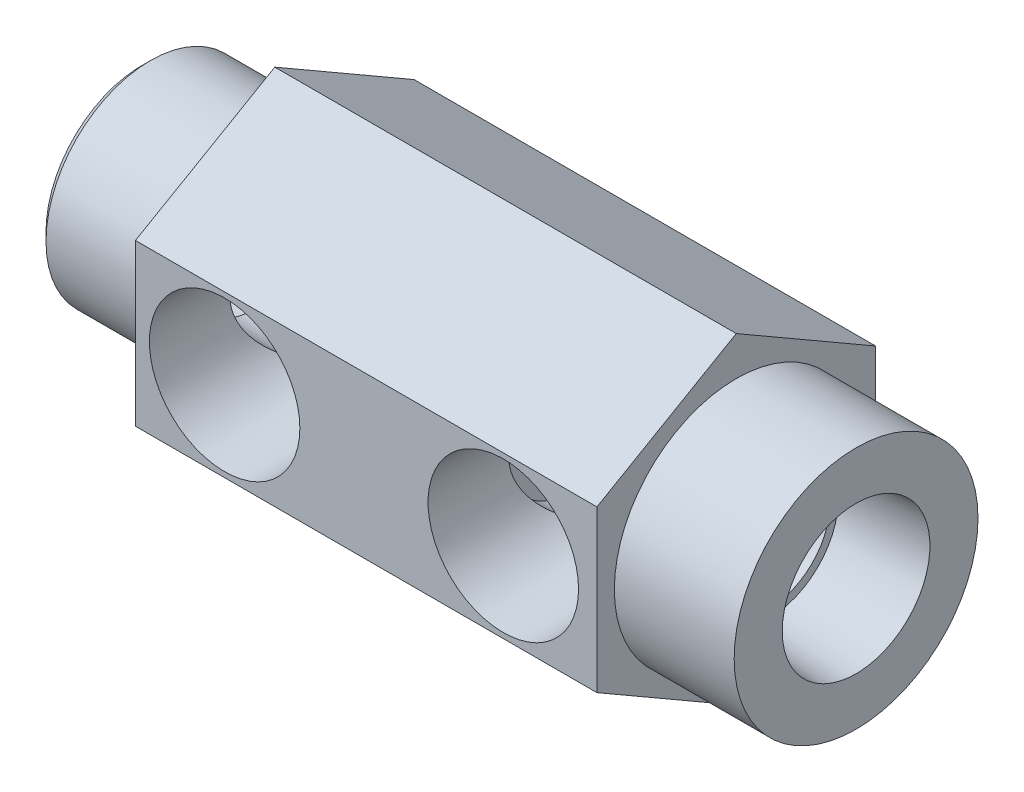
ISO-10303-21;
HEADER;
FILE_DESCRIPTION(('STEP AP214'),'2;1');
FILE_NAME('part.step','',(''),(''),'','','');
FILE_SCHEMA(('AUTOMOTIVE_DESIGN { 1 0 10303 214 1 1 1 1 }'));
ENDSEC;
DATA;
#1=APPLICATION_CONTEXT('core data for automotive mechanical design processes');
#2=APPLICATION_PROTOCOL_DEFINITION('international standard','automotive_design',2000,#1);
#3=PRODUCT_CONTEXT('',#1,'mechanical');
#4=PRODUCT('Part','Part','',(#3));
#5=PRODUCT_RELATED_PRODUCT_CATEGORY('part','',(#4));
#6=PRODUCT_DEFINITION_FORMATION('','',#4);
#7=PRODUCT_DEFINITION_CONTEXT('part definition',#1,'design');
#8=PRODUCT_DEFINITION('design','',#6,#7);
#9=PRODUCT_DEFINITION_SHAPE('','',#8);
#10=(LENGTH_UNIT() NAMED_UNIT(*) SI_UNIT(.MILLI.,.METRE.));
#11=(NAMED_UNIT(*) PLANE_ANGLE_UNIT() SI_UNIT($,.RADIAN.));
#12=(NAMED_UNIT(*) SI_UNIT($,.STERADIAN.) SOLID_ANGLE_UNIT());
#13=UNCERTAINTY_MEASURE_WITH_UNIT(LENGTH_MEASURE(1.E-05),#10,'distance_accuracy_value','');
#14=(GEOMETRIC_REPRESENTATION_CONTEXT(3) GLOBAL_UNCERTAINTY_ASSIGNED_CONTEXT((#13)) GLOBAL_UNIT_ASSIGNED_CONTEXT((#10,
#11,#12)) REPRESENTATION_CONTEXT('',''));
#15=CARTESIAN_POINT('',(0.,0.,0.));
#16=DIRECTION('',(0.,0.,1.));
#17=DIRECTION('',(1.,0.,0.));
#18=AXIS2_PLACEMENT_3D('',#15,#16,#17);
#19=CARTESIAN_POINT('',(13.6906,0.,2.6797));
#20=DIRECTION('',(0.,0.,-1.));
#21=DIRECTION('',(-1.,0.,0.));
#22=AXIS2_PLACEMENT_3D('',#19,#20,#21);
#23=PLANE('',#22);
#24=CARTESIAN_POINT('',(8.128,0.,2.6797));
#25=DIRECTION('',(0.,0.,1.));
#26=DIRECTION('',(1.,0.,0.));
#27=AXIS2_PLACEMENT_3D('',#24,#25,#26);
#28=CIRCLE('',#27,6.55797879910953);
#29=CARTESIAN_POINT('',(3.74104669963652,-4.8746001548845,2.6797));
#30=VERTEX_POINT('',#29);
#31=CARTESIAN_POINT('',(12.5149533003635,-4.8746001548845,2.6797));
#32=VERTEX_POINT('',#31);
#33=EDGE_CURVE('E221',#30,#32,#28,.T.);
#34=ORIENTED_EDGE('',*,*,#33,.T.);
#35=DIRECTION('',(-1.,0.,0.));
#36=VECTOR('',#35,1.);
#37=CARTESIAN_POINT('',(-12.0904,-4.8746001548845,2.6797));
#38=LINE('',#37,#36);
#39=CARTESIAN_POINT('',(10.8077,-4.8746001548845,2.6797));
#40=VERTEX_POINT('',#39);
#41=EDGE_CURVE('E482',#32,#40,#38,.T.);
#42=ORIENTED_EDGE('',*,*,#41,.T.);
#43=CARTESIAN_POINT('',(8.128,0.,2.6797));
#44=DIRECTION('',(0.,0.,1.));
#45=DIRECTION('',(1.,0.,0.));
#46=AXIS2_PLACEMENT_3D('',#43,#44,#45);
#47=CIRCLE('',#46,5.5626);
#48=CARTESIAN_POINT('',(5.4483,-4.8746001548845,2.6797));
#49=VERTEX_POINT('',#48);
#50=EDGE_CURVE('E225',#49,#40,#47,.T.);
#51=ORIENTED_EDGE('',*,*,#50,.F.);
#52=EDGE_CURVE('E476',#49,#30,#38,.T.);
#53=ORIENTED_EDGE('',*,*,#52,.T.);
#54=EDGE_LOOP('',(#34,#42,#51,#53));
#55=FACE_BOUND('',#54,.T.);
#56=ADVANCED_FACE('F36',(#55),#23,.F.);
#57=CARTESIAN_POINT('',(13.6906,0.,-2.6797));
#58=DIRECTION('',(0.,0.,1.));
#59=DIRECTION('',(0.,-1.,0.));
#60=AXIS2_PLACEMENT_3D('',#57,#58,#59);
#61=PLANE('',#60);
#62=CARTESIAN_POINT('',(8.128,0.,-2.6797));
#63=DIRECTION('',(0.,0.,-1.));
#64=DIRECTION('',(0.,1.,0.));
#65=AXIS2_PLACEMENT_3D('',#62,#63,#64);
#66=CIRCLE('',#65,6.55797879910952);
#67=CARTESIAN_POINT('',(3.74104669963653,4.8746001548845,-2.6797));
#68=VERTEX_POINT('',#67);
#69=CARTESIAN_POINT('',(12.5149533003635,4.8746001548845,-2.6797));
#70=VERTEX_POINT('',#69);
#71=EDGE_CURVE('E199',#68,#70,#66,.T.);
#72=ORIENTED_EDGE('',*,*,#71,.T.);
#73=DIRECTION('',(-1.,0.,0.));
#74=VECTOR('',#73,1.);
#75=CARTESIAN_POINT('',(-12.0904,4.8746001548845,-2.6797));
#76=LINE('',#75,#74);
#77=CARTESIAN_POINT('',(10.8077,4.8746001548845,-2.6797));
#78=VERTEX_POINT('',#77);
#79=EDGE_CURVE('E204',#70,#78,#76,.T.);
#80=ORIENTED_EDGE('',*,*,#79,.T.);
#81=CARTESIAN_POINT('',(8.128,0.,-2.6797));
#82=DIRECTION('',(0.,0.,-1.));
#83=DIRECTION('',(0.,1.,0.));
#84=AXIS2_PLACEMENT_3D('',#81,#82,#83);
#85=CIRCLE('',#84,5.56260000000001);
#86=CARTESIAN_POINT('',(5.44829999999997,4.8746001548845,-2.6797));
#87=VERTEX_POINT('',#86);
#88=EDGE_CURVE('E201',#87,#78,#85,.T.);
#89=ORIENTED_EDGE('',*,*,#88,.F.);
#90=EDGE_CURVE('E183',#87,#68,#76,.T.);
#91=ORIENTED_EDGE('',*,*,#90,.T.);
#92=EDGE_LOOP('',(#72,#80,#89,#91));
#93=FACE_BOUND('',#92,.T.);
#94=ADVANCED_FACE('F197',(#93),#61,.F.);
#95=CARTESIAN_POINT('',(8.128,0.,12.7));
#96=DIRECTION('',(0.,0.,1.));
#97=DIRECTION('',(1.,0.,0.));
#98=AXIS2_PLACEMENT_3D('',#95,#96,#97);
#99=CYLINDRICAL_SURFACE('',#98,5.56260000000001);
#100=CARTESIAN_POINT('',(8.128,0.,0.));
#101=DIRECTION('',(0.707106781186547,0.,0.707106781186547));
#102=DIRECTION('',(-0.707106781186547,0.,0.707106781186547));
#103=AXIS2_PLACEMENT_3D('',#100,#101,#102);
#104=ELLIPSE('',#103,7.86670436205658,5.5626);
#105=CARTESIAN_POINT('',(5.4483,4.8746001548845,2.6797));
#106=VERTEX_POINT('',#105);
#107=CARTESIAN_POINT('',(8.128,5.5626,0.));
#108=VERTEX_POINT('',#107);
#109=EDGE_CURVE('E489',#106,#108,#104,.F.);
#110=ORIENTED_EDGE('',*,*,#109,.T.);
#111=CARTESIAN_POINT('',(8.128,0.,0.));
#112=DIRECTION('',(-0.707106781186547,0.,0.707106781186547));
#113=DIRECTION('',(0.707106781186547,0.,0.707106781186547));
#114=AXIS2_PLACEMENT_3D('',#111,#112,#113);
#115=ELLIPSE('',#114,7.86670436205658,5.5626);
#116=CARTESIAN_POINT('',(10.8077,4.8746001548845,2.6797));
#117=VERTEX_POINT('',#116);
#118=EDGE_CURVE('E537',#108,#117,#115,.F.);
#119=ORIENTED_EDGE('',*,*,#118,.T.);
#120=EDGE_CURVE('E226',#117,#106,#47,.T.);
#121=ORIENTED_EDGE('',*,*,#120,.T.);
#122=EDGE_LOOP('',(#110,#119,#121));
#123=FACE_BOUND('',#122,.T.);
#124=ADVANCED_FACE('F451',(#123),#99,.F.);
#125=CARTESIAN_POINT('',(8.128,0.,0.));
#126=DIRECTION('',(0.707106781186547,0.,0.707106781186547));
#127=DIRECTION('',(-0.707106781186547,0.,0.707106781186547));
#128=AXIS2_PLACEMENT_3D('',#125,#126,#127);
#129=ELLIPSE('',#128,7.86670436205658,5.5626);
#130=EDGE_CURVE('E522',#78,#108,#129,.T.);
#131=ORIENTED_EDGE('',*,*,#130,.T.);
#132=CARTESIAN_POINT('',(8.128,0.,0.));
#133=DIRECTION('',(-0.707106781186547,0.,0.707106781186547));
#134=DIRECTION('',(0.707106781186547,0.,0.707106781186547));
#135=AXIS2_PLACEMENT_3D('',#132,#133,#134);
#136=ELLIPSE('',#135,7.86670436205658,5.5626);
#137=EDGE_CURVE('E534',#108,#87,#136,.T.);
#138=ORIENTED_EDGE('',*,*,#137,.T.);
#139=ORIENTED_EDGE('',*,*,#88,.T.);
#140=EDGE_LOOP('',(#131,#138,#139));
#141=FACE_BOUND('',#140,.T.);
#142=ADVANCED_FACE('F544',(#141),#99,.F.);
#143=ORIENTED_EDGE('',*,*,#50,.T.);
#144=CARTESIAN_POINT('',(8.128,-5.5626,0.));
#145=VERTEX_POINT('',#144);
#146=EDGE_CURVE('E535',#40,#145,#115,.F.);
#147=ORIENTED_EDGE('',*,*,#146,.T.);
#148=EDGE_CURVE('E51',#145,#49,#104,.F.);
#149=ORIENTED_EDGE('',*,*,#148,.T.);
#150=EDGE_LOOP('',(#143,#147,#149));
#151=FACE_BOUND('',#150,.T.);
#152=ADVANCED_FACE('F394',(#151),#99,.F.);
#153=CARTESIAN_POINT('',(52.9844,0.,0.));
#154=DIRECTION('',(1.,0.,0.));
#155=DIRECTION('',(0.,0.,-1.));
#156=AXIS2_PLACEMENT_3D('',#153,#154,#155);
#157=PLANE('',#156);
#158=CARTESIAN_POINT('',(52.9844,0.,0.));
#159=DIRECTION('',(1.,0.,0.));
#160=DIRECTION('',(0.,0.,-1.));
#161=AXIS2_PLACEMENT_3D('',#158,#159,#160);
#162=CIRCLE('',#161,11.1125);
#163=CARTESIAN_POINT('',(52.9844,0.,11.1125));
#164=VERTEX_POINT('',#163);
#165=EDGE_CURVE('E244',#164,#164,#162,.T.);
#166=ORIENTED_EDGE('',*,*,#165,.T.);
#167=EDGE_LOOP('',(#166));
#168=FACE_BOUND('',#167,.T.);
#169=CARTESIAN_POINT('',(52.9844,0.,0.));
#170=DIRECTION('',(-1.,0.,0.));
#171=DIRECTION('',(0.,0.,1.));
#172=AXIS2_PLACEMENT_3D('',#169,#170,#171);
#173=CIRCLE('',#172,6.73100000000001);
#174=CARTESIAN_POINT('',(52.9844,0.,6.73100000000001));
#175=VERTEX_POINT('',#174);
#176=EDGE_CURVE('E898',#175,#175,#173,.T.);
#177=ORIENTED_EDGE('',*,*,#176,.T.);
#178=EDGE_LOOP('',(#177));
#179=FACE_BOUND('',#178,.T.);
#180=ADVANCED_FACE('F379',(#168,#179),#157,.T.);
#181=CARTESIAN_POINT('',(33.528,0.,-4.3688));
#182=DIRECTION('',(0.,0.,1.));
#183=DIRECTION('',(1.,0.,0.));
#184=AXIS2_PLACEMENT_3D('',#181,#182,#183);
#185=CONICAL_SURFACE('',#184,5.56260000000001,1.02974425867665);
#186=CARTESIAN_POINT('',(33.528,0.,-7.71114727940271));
#187=VERTEX_POINT('',#186);
#188=VERTEX_LOOP('',#187);
#189=FACE_BOUND('',#188,.T.);
#190=CARTESIAN_POINT('',(38.0487439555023,3.56857461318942,-4.25049));
#191=CARTESIAN_POINT('',(37.9870732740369,3.50636330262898,-4.30271789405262));
#192=CARTESIAN_POINT('',(37.927793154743,3.44155455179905,-4.35480272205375));
#193=CARTESIAN_POINT('',(37.8147987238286,3.30651058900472,-4.45820907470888));
#194=CARTESIAN_POINT('',(37.7610917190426,3.23626845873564,-4.50952952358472));
#195=CARTESIAN_POINT('',(37.6606984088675,3.09101864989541,-4.61028400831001));
#196=CARTESIAN_POINT('',(37.613947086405,3.01606583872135,-4.65973180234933));
#197=CARTESIAN_POINT('',(37.5275186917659,2.86096872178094,-4.75653204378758));
#198=CARTESIAN_POINT('',(37.4878378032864,2.7808272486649,-4.80388561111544));
#199=CARTESIAN_POINT('',(37.4155798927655,2.61513265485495,-4.89607197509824));
#200=CARTESIAN_POINT('',(37.3830571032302,2.52954415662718,-4.94088373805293));
#201=CARTESIAN_POINT('',(37.32532616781,2.35414512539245,-5.02682106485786));
#202=CARTESIAN_POINT('',(37.300119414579,2.26433379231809,-5.0679459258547));
#203=CARTESIAN_POINT('',(37.2563418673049,2.08115803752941,-5.1458810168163));
#204=CARTESIAN_POINT('',(37.2377799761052,1.9877890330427,-5.18268541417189));
#205=CARTESIAN_POINT('',(37.2063059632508,1.79833671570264,-5.25143227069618));
#206=CARTESIAN_POINT('',(37.1933958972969,1.70225242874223,-5.28337295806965));
#207=CARTESIAN_POINT('',(37.1677554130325,1.46919131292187,-5.35378556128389));
#208=CARTESIAN_POINT('',(37.1571605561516,1.33122442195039,-5.38976291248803));
#209=CARTESIAN_POINT('',(37.1415122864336,1.05262087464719,-5.45103233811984));
#210=CARTESIAN_POINT('',(37.1364613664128,0.911983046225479,-5.47631960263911));
#211=CARTESIAN_POINT('',(37.1294196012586,0.628685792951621,-5.51603682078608));
#212=CARTESIAN_POINT('',(37.1274379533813,0.486021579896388,-5.53043407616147));
#213=CARTESIAN_POINT('',(37.125093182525,0.200028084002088,-5.5481441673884));
#214=CARTESIAN_POINT('',(37.1247297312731,0.0566989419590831,-5.5514592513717));
#215=CARTESIAN_POINT('',(37.1252807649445,-0.233620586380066,-5.5469313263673));
#216=CARTESIAN_POINT('',(37.1262297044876,-0.380606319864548,-5.53878738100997));
#217=CARTESIAN_POINT('',(37.1303514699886,-0.67348776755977,-5.51084816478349));
#218=CARTESIAN_POINT('',(37.1335249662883,-0.819383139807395,-5.49104938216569));
#219=CARTESIAN_POINT('',(37.1441832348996,-1.10845549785,-5.44005296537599));
#220=CARTESIAN_POINT('',(37.1516516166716,-1.25164069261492,-5.40889883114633));
#221=CARTESIAN_POINT('',(37.173991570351,-1.53454079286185,-5.33553008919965));
#222=CARTESIAN_POINT('',(37.1888580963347,-1.67425799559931,-5.2933230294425));
#223=CARTESIAN_POINT('',(37.2230332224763,-1.90453819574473,-5.21381382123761));
#224=CARTESIAN_POINT('',(37.2393892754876,-1.99649821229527,-5.1792779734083));
#225=CARTESIAN_POINT('',(37.2781834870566,-2.17734763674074,-5.10588468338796));
#226=CARTESIAN_POINT('',(37.3006194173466,-2.26623815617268,-5.06702882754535));
#227=CARTESIAN_POINT('',(37.3523080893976,-2.44022162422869,-4.98557264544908));
#228=CARTESIAN_POINT('',(37.3815589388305,-2.52531561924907,-4.94297336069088));
#229=CARTESIAN_POINT('',(37.4471933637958,-2.69105186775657,-4.85473403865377));
#230=CARTESIAN_POINT('',(37.4835759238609,-2.77169475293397,-4.80909443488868));
#231=CARTESIAN_POINT('',(37.5577947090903,-2.91721547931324,-4.72201343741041));
#232=CARTESIAN_POINT('',(37.5947328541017,-2.98273052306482,-4.68086521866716));
#233=CARTESIAN_POINT('',(37.6734702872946,-3.10995290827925,-4.59732257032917));
#234=CARTESIAN_POINT('',(37.7152706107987,-3.17165943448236,-4.554927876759));
#235=CARTESIAN_POINT('',(37.803448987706,-3.29146120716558,-4.46913061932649));
#236=CARTESIAN_POINT('',(37.8498450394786,-3.34954067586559,-4.42572464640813));
#237=CARTESIAN_POINT('',(37.9465126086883,-3.46187931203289,-4.33841352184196));
#238=CARTESIAN_POINT('',(37.9967810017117,-3.51614149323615,-4.29450879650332));
#239=CARTESIAN_POINT('',(38.0487439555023,-3.56857461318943,-4.25049));
#240=B_SPLINE_CURVE_WITH_KNOTS('',3,(#190,#191,#192,#193,#194,#195,#196,#197,#198,#199,#200,
#201,#202,#203,#204,#205,#206,#207,#208,#209,#210,#211,#212,#213,#214,#215,#216,#217,#218,#219,
#220,#221,#222,#223,#224,#225,#226,#227,#228,#229,#230,#231,#232,#233,#234,#235,#236,#237,#238,
#239),.UNSPECIFIED.,.F.,.F.,(4,2,2,2,2,2,2,2,2,2,2,2,2,2,2,2,2,2,2,2,2,2,2,2,4),(0.,
0.305998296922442,0.61239284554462,0.915714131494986,1.21887119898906,1.52425155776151,
1.82969000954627,2.13553617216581,2.44149348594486,2.86977815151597,3.29825531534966,
3.72801396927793,4.15768543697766,4.59885384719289,5.04015525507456,5.47978359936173,
5.91911250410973,6.21758087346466,6.51594000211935,6.81421638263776,7.1124503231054,
7.36940866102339,7.62642181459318,7.88448461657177,8.14234133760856),.UNSPECIFIED.);
#241=CARTESIAN_POINT('',(37.9129221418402,3.42271479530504,-4.3688));
#242=VERTEX_POINT('',#241);
#243=CARTESIAN_POINT('',(37.9129221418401,-3.42271479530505,-4.3688));
#244=VERTEX_POINT('',#243);
#245=EDGE_CURVE('E212',#242,#244,#240,.T.);
#246=ORIENTED_EDGE('',*,*,#245,.F.);
#247=CARTESIAN_POINT('',(33.528,0.,-4.3688));
#248=DIRECTION('',(0.,0.,1.));
#249=DIRECTION('',(1.,0.,0.));
#250=AXIS2_PLACEMENT_3D('',#247,#248,#249);
#251=CIRCLE('',#250,5.56260000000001);
#252=CARTESIAN_POINT('',(29.1430778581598,3.42271479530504,-4.3688));
#253=VERTEX_POINT('',#252);
#254=EDGE_CURVE('E241',#242,#253,#251,.T.);
#255=ORIENTED_EDGE('',*,*,#254,.T.);
#256=CARTESIAN_POINT('',(29.0072560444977,-3.56857461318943,-4.25049));
#257=CARTESIAN_POINT('',(29.0689267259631,-3.50636330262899,-4.30271789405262));
#258=CARTESIAN_POINT('',(29.1282068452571,-3.44155455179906,-4.35480272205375));
#259=CARTESIAN_POINT('',(29.2412012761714,-3.30651058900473,-4.45820907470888));
#260=CARTESIAN_POINT('',(29.2949082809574,-3.23626845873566,-4.50952952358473));
#261=CARTESIAN_POINT('',(29.3953015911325,-3.09101864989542,-4.61028400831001));
#262=CARTESIAN_POINT('',(29.442052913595,-3.01606583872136,-4.65973180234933));
#263=CARTESIAN_POINT('',(29.5284813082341,-2.86096872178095,-4.75653204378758));
#264=CARTESIAN_POINT('',(29.5681621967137,-2.78082724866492,-4.80388561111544));
#265=CARTESIAN_POINT('',(29.6404201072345,-2.61513265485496,-4.89607197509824));
#266=CARTESIAN_POINT('',(29.6729428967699,-2.52954415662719,-4.94088373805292));
#267=CARTESIAN_POINT('',(29.73067383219,-2.35414512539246,-5.02682106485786));
#268=CARTESIAN_POINT('',(29.755880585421,-2.26433379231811,-5.06794592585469));
#269=CARTESIAN_POINT('',(29.7996581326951,-2.08115803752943,-5.14588101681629));
#270=CARTESIAN_POINT('',(29.8182200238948,-1.98778903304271,-5.18268541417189));
#271=CARTESIAN_POINT('',(29.8496940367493,-1.79833671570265,-5.25143227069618));
#272=CARTESIAN_POINT('',(29.8626041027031,-1.70225242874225,-5.28337295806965));
#273=CARTESIAN_POINT('',(29.8882445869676,-1.46919131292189,-5.35378556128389));
#274=CARTESIAN_POINT('',(29.8988394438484,-1.33122442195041,-5.38976291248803));
#275=CARTESIAN_POINT('',(29.9144877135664,-1.05262087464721,-5.45103233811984));
#276=CARTESIAN_POINT('',(29.9195386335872,-0.911983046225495,-5.47631960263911));
#277=CARTESIAN_POINT('',(29.9265803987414,-0.628685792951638,-5.51603682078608));
#278=CARTESIAN_POINT('',(29.9285620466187,-0.486021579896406,-5.53043407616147));
#279=CARTESIAN_POINT('',(29.930906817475,-0.200028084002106,-5.5481441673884));
#280=CARTESIAN_POINT('',(29.9312702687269,-0.0566989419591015,-5.5514592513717));
#281=CARTESIAN_POINT('',(29.9307192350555,0.233620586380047,-5.5469313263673));
#282=CARTESIAN_POINT('',(29.9297702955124,0.380606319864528,-5.53878738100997));
#283=CARTESIAN_POINT('',(29.9256485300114,0.67348776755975,-5.51084816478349));
#284=CARTESIAN_POINT('',(29.9224750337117,0.819383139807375,-5.49104938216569));
#285=CARTESIAN_POINT('',(29.9118167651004,1.10845549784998,-5.44005296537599));
#286=CARTESIAN_POINT('',(29.9043483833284,1.25164069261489,-5.40889883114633));
#287=CARTESIAN_POINT('',(29.882008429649,1.53454079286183,-5.33553008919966));
#288=CARTESIAN_POINT('',(29.8671419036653,1.67425799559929,-5.2933230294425));
#289=CARTESIAN_POINT('',(29.8329667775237,1.9045381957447,-5.21381382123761));
#290=CARTESIAN_POINT('',(29.8166107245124,1.99649821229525,-5.1792779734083));
#291=CARTESIAN_POINT('',(29.7778165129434,2.17734763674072,-5.10588468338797));
#292=CARTESIAN_POINT('',(29.7553805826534,2.26623815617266,-5.06702882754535));
#293=CARTESIAN_POINT('',(29.7036919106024,2.44022162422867,-4.98557264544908));
#294=CARTESIAN_POINT('',(29.6744410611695,2.52531561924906,-4.94297336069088));
#295=CARTESIAN_POINT('',(29.6088066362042,2.69105186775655,-4.85473403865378));
#296=CARTESIAN_POINT('',(29.5724240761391,2.77169475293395,-4.80909443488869));
#297=CARTESIAN_POINT('',(29.4982052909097,2.91721547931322,-4.72201343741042));
#298=CARTESIAN_POINT('',(29.4612671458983,2.98273052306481,-4.68086521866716));
#299=CARTESIAN_POINT('',(29.3825297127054,3.10995290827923,-4.59732257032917));
#300=CARTESIAN_POINT('',(29.3407293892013,3.17165943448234,-4.554927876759));
#301=CARTESIAN_POINT('',(29.252551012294,3.29146120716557,-4.46913061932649));
#302=CARTESIAN_POINT('',(29.2061549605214,3.34954067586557,-4.42572464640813));
#303=CARTESIAN_POINT('',(29.1094873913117,3.46187931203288,-4.33841352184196));
#304=CARTESIAN_POINT('',(29.0592189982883,3.51614149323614,-4.29450879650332));
#305=CARTESIAN_POINT('',(29.0072560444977,3.56857461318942,-4.25049));
#306=B_SPLINE_CURVE_WITH_KNOTS('',3,(#256,#257,#258,#259,#260,#261,#262,#263,#264,#265,#266,
#267,#268,#269,#270,#271,#272,#273,#274,#275,#276,#277,#278,#279,#280,#281,#282,#283,#284,#285,
#286,#287,#288,#289,#290,#291,#292,#293,#294,#295,#296,#297,#298,#299,#300,#301,#302,#303,#304,
#305),.UNSPECIFIED.,.F.,.F.,(4,2,2,2,2,2,2,2,2,2,2,2,2,2,2,2,2,2,2,2,2,2,2,2,4),(0.,
0.305998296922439,0.61239284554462,0.915714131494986,1.21887119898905,1.5242515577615,
1.82969000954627,2.13553617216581,2.44149348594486,2.86977815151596,3.29825531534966,
3.72801396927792,4.15768543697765,4.59885384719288,5.04015525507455,5.47978359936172,
5.91911250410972,6.21758087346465,6.51594000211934,6.81421638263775,7.1124503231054,
7.36940866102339,7.62642181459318,7.88448461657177,8.14234133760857),.UNSPECIFIED.);
#307=CARTESIAN_POINT('',(29.1430778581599,-3.42271479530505,-4.3688));
#308=VERTEX_POINT('',#307);
#309=EDGE_CURVE('E344',#308,#253,#306,.T.);
#310=ORIENTED_EDGE('',*,*,#309,.F.);
#311=EDGE_CURVE('E240',#308,#244,#251,.T.);
#312=ORIENTED_EDGE('',*,*,#311,.T.);
#313=EDGE_LOOP('',(#246,#255,#310,#312));
#314=FACE_BOUND('',#313,.T.);
#315=ADVANCED_FACE('F370',(#189,#314),#185,.F.);
#316=CARTESIAN_POINT('',(33.528,0.,12.7));
#317=DIRECTION('',(0.,0.,1.));
#318=DIRECTION('',(1.,0.,0.));
#319=AXIS2_PLACEMENT_3D('',#316,#317,#318);
#320=CYLINDRICAL_SURFACE('',#319,5.56260000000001);
#321=CARTESIAN_POINT('',(29.1430778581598,3.42271479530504,-4.3688));
#322=CARTESIAN_POINT('',(29.2053786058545,3.50252392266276,-4.30626922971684));
#323=CARTESIAN_POINT('',(29.2692305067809,3.57983993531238,-4.24217199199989));
#324=CARTESIAN_POINT('',(29.3997001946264,3.72954742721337,-4.111175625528));
#325=CARTESIAN_POINT('',(29.4663169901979,3.80194064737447,-4.0442775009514));
#326=CARTESIAN_POINT('',(29.6696020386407,4.01162562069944,-3.84008739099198));
#327=CARTESIAN_POINT('',(29.8099614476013,4.14174719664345,-3.69904228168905));
#328=CARTESIAN_POINT('',(30.0975597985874,4.38288342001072,-3.40984184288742));
#329=CARTESIAN_POINT('',(30.2447640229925,4.4939834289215,-3.26172230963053));
#330=CARTESIAN_POINT('',(30.5450099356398,4.69864874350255,-2.95929639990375));
#331=CARTESIAN_POINT('',(30.6980539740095,4.79220689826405,-2.80498753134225));
#332=CARTESIAN_POINT('',(30.9831508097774,4.94855700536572,-2.51703491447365));
#333=CARTESIAN_POINT('',(31.1145644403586,5.01387804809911,-2.38411695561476));
#334=CARTESIAN_POINT('',(31.3796036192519,5.13303105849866,-2.11541586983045));
#335=CARTESIAN_POINT('',(31.5132288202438,5.1868648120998,-1.97963319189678));
#336=CARTESIAN_POINT('',(31.7816711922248,5.28329287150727,-1.7056562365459));
#337=CARTESIAN_POINT('',(31.9164866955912,5.32590091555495,-1.56746512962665));
#338=CARTESIAN_POINT('',(32.1863893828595,5.40019502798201,-1.28848056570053));
#339=CARTESIAN_POINT('',(32.3214764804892,5.43188413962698,-1.14768784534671));
#340=CARTESIAN_POINT('',(32.5189904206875,5.47070908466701,-0.936746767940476));
#341=CARTESIAN_POINT('',(32.5823943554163,5.48200911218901,-0.868244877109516));
#342=CARTESIAN_POINT('',(32.7080219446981,5.50219723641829,-0.729494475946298));
#343=CARTESIAN_POINT('',(32.7702429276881,5.51108036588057,-0.659242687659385));
#344=CARTESIAN_POINT('',(32.878517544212,5.5247658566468,-0.530668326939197));
#345=CARTESIAN_POINT('',(32.9252277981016,5.53003323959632,-0.4729291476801));
#346=CARTESIAN_POINT('',(33.0138391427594,5.53895660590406,-0.353523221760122));
#347=CARTESIAN_POINT('',(33.0557550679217,5.54261766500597,-0.291869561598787));
#348=CARTESIAN_POINT('',(33.1029068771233,5.54635110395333,-0.200071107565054));
#349=CARTESIAN_POINT('',(33.1149282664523,5.54725075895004,-0.17362424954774));
#350=CARTESIAN_POINT('',(33.1346806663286,5.54868581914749,-0.11920938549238));
#351=CARTESIAN_POINT('',(33.1424339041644,5.54922311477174,-0.091250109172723));
#352=CARTESIAN_POINT('',(33.1507682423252,5.54979551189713,-0.0406082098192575));
#353=CARTESIAN_POINT('',(33.1525611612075,5.54991574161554,-0.0181354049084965));
#354=CARTESIAN_POINT('',(33.1520473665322,5.5498809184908,0.0267461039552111));
#355=CARTESIAN_POINT('',(33.1497432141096,5.54972603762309,0.0491548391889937));
#356=CARTESIAN_POINT('',(33.1402182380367,5.54906942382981,0.100345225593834));
#357=CARTESIAN_POINT('',(33.1316568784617,5.54847233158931,0.128864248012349));
#358=CARTESIAN_POINT('',(33.1103226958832,5.54690714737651,0.184367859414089));
#359=CARTESIAN_POINT('',(33.0975213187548,5.54593653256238,0.21134054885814));
#360=CARTESIAN_POINT('',(33.0586644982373,5.54281975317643,0.284099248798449));
#361=CARTESIAN_POINT('',(33.0299816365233,5.5403433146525,0.328420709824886));
#362=CARTESIAN_POINT('',(32.9692649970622,5.5345538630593,0.414689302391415));
#363=CARTESIAN_POINT('',(32.9372207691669,5.53123819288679,0.456628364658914));
#364=CARTESIAN_POINT('',(32.8710999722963,5.52377748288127,0.539458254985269));
#365=CARTESIAN_POINT('',(32.8370069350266,5.51962483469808,0.580335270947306));
#366=CARTESIAN_POINT('',(32.7679056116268,5.51053473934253,0.661091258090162));
#367=CARTESIAN_POINT('',(32.7328988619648,5.50559854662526,0.700971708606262));
#368=CARTESIAN_POINT('',(32.6194514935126,5.48846855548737,0.828218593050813));
#369=CARTESIAN_POINT('',(32.5399173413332,5.47474378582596,0.914407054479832));
#370=CARTESIAN_POINT('',(32.3799423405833,5.44345110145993,1.08523802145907));
#371=CARTESIAN_POINT('',(32.2995012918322,5.42588232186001,1.16988017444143));
#372=CARTESIAN_POINT('',(32.0576616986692,5.36731988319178,1.4223942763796));
#373=CARTESIAN_POINT('',(31.8959389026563,5.32049832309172,1.58864694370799));
#374=CARTESIAN_POINT('',(31.5803741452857,5.21306486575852,1.91130379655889));
#375=CARTESIAN_POINT('',(31.4264669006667,5.15304719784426,2.06784173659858));
#376=CARTESIAN_POINT('',(31.1978738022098,5.05172859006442,2.29968019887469));
#377=CARTESIAN_POINT('',(31.1221017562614,5.01610006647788,2.37641685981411));
#378=CARTESIAN_POINT('',(30.9714170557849,4.94100069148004,2.52885627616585));
#379=CARTESIAN_POINT('',(30.89650445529,4.90152959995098,2.60455896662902));
#380=CARTESIAN_POINT('',(30.8220951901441,4.8601026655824,2.67969999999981));
#381=B_SPLINE_CURVE_WITH_KNOTS('',3,(#321,#322,#323,#324,#325,#326,#327,#328,#329,#330,#331,
#332,#333,#334,#335,#336,#337,#338,#339,#340,#341,#342,#343,#344,#345,#346,#347,#348,#349,#350,
#351,#352,#353,#354,#355,#356,#357,#358,#359,#360,#361,#362,#363,#364,#365,#366,#367,#368,#369,
#370,#371,#372,#373,#374,#375,#376,#377,#378,#379,#380),.UNSPECIFIED.,.F.,.F.,(4,2,2,2,2,2,2,2,
2,2,2,2,2,2,2,2,2,2,2,2,2,2,2,2,2,2,2,2,2,4),(0.,0.356890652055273,0.713654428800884,
1.42572741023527,2.13451598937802,2.84359287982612,3.4372250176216,4.03076479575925,
4.6235747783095,5.2162194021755,5.49827347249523,5.78090291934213,6.00433449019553,
6.22705487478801,6.3140330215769,6.40055381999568,6.46782718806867,6.53505851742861,
6.62386536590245,6.71328286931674,6.87138898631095,7.03000208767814,7.19012792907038,
7.34999994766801,7.70411945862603,8.05831872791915,8.7675669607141,9.44975807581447,
9.7904185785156,10.1311003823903),.UNSPECIFIED.);
#382=CARTESIAN_POINT('',(30.8220951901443,4.86010266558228,2.6797));
#383=VERTEX_POINT('',#382);
#384=EDGE_CURVE('E337',#253,#383,#381,.T.);
#385=ORIENTED_EDGE('',*,*,#384,.F.);
#386=ORIENTED_EDGE('',*,*,#254,.F.);
#387=CARTESIAN_POINT('',(36.2339048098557,4.86010266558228,2.6797));
#388=CARTESIAN_POINT('',(36.1573626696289,4.90271691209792,2.6024048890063));
#389=CARTESIAN_POINT('',(36.0802883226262,4.94326160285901,2.52451611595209));
#390=CARTESIAN_POINT('',(35.9252343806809,5.02028696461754,2.36764700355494));
#391=CARTESIAN_POINT('',(35.8472548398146,5.05676787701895,2.28866672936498));
#392=CARTESIAN_POINT('',(35.6120714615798,5.16028405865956,2.05010484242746));
#393=CARTESIAN_POINT('',(35.4537326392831,5.22133212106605,1.88901283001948));
#394=CARTESIAN_POINT('',(35.1345730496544,5.32821249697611,1.56246076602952));
#395=CARTESIAN_POINT('',(34.9737434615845,5.37396013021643,1.39698170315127));
#396=CARTESIAN_POINT('',(34.7333316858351,5.43106765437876,1.14553430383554));
#397=CARTESIAN_POINT('',(34.6533574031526,5.44818105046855,1.06120651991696));
#398=CARTESIAN_POINT('',(34.4943992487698,5.47860389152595,0.890954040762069));
#399=CARTESIAN_POINT('',(34.4154151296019,5.49191430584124,0.805029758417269));
#400=CARTESIAN_POINT('',(34.2931936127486,5.50990529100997,0.667021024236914));
#401=CARTESIAN_POINT('',(34.2489571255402,5.51585557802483,0.615983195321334));
#402=CARTESIAN_POINT('',(34.1624383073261,5.52647109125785,0.512104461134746));
#403=CARTESIAN_POINT('',(34.1201555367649,5.5311366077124,0.459263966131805));
#404=CARTESIAN_POINT('',(34.0564332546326,5.53749527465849,0.372271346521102));
#405=CARTESIAN_POINT('',(34.033506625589,5.53962582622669,0.339251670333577));
#406=CARTESIAN_POINT('',(33.9905937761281,5.54337271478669,0.271242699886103));
#407=CARTESIAN_POINT('',(33.9706061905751,5.54498929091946,0.236254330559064));
#408=CARTESIAN_POINT('',(33.9426831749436,5.54713245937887,0.176754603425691));
#409=CARTESIAN_POINT('',(33.933013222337,5.54784146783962,0.153090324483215));
#410=CARTESIAN_POINT('',(33.9172951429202,5.54896659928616,0.104612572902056));
#411=CARTESIAN_POINT('',(33.9112335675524,5.54938381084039,0.0798037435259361));
#412=CARTESIAN_POINT('',(33.9039509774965,5.54988255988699,0.029035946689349));
#413=CARTESIAN_POINT('',(33.9028053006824,5.54995887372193,0.00306520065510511));
#414=CARTESIAN_POINT('',(33.9059120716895,5.54974795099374,-0.0485454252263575));
#415=CARTESIAN_POINT('',(33.9101699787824,5.54946034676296,-0.0741849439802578));
#416=CARTESIAN_POINT('',(33.9247955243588,5.54843534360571,-0.131549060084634));
#417=CARTESIAN_POINT('',(33.9365743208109,5.54759189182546,-0.162888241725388));
#418=CARTESIAN_POINT('',(33.9643836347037,5.54547446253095,-0.223685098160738));
#419=CARTESIAN_POINT('',(33.9804398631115,5.54419786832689,-0.25313001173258));
#420=CARTESIAN_POINT('',(34.0343579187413,5.53962508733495,-0.343123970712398));
#421=CARTESIAN_POINT('',(34.0763107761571,5.5356796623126,-0.40110731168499));
#422=CARTESIAN_POINT('',(34.1638595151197,5.52631907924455,-0.51417606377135));
#423=CARTESIAN_POINT('',(34.2094670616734,5.52089907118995,-0.569251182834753));
#424=CARTESIAN_POINT('',(34.3026304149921,5.50860024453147,-0.678027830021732));
#425=CARTESIAN_POINT('',(34.350194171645,5.50171487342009,-0.731721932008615));
#426=CARTESIAN_POINT('',(34.4461025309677,5.48652622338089,-0.838028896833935));
#427=CARTESIAN_POINT('',(34.4944457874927,5.47822519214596,-0.890643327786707));
#428=CARTESIAN_POINT('',(34.6402922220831,5.45115530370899,-1.04766823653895));
#429=CARTESIAN_POINT('',(34.7384665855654,5.43023844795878,-1.15109678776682));
#430=CARTESIAN_POINT('',(34.9351156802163,5.38263989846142,-1.35633654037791));
#431=CARTESIAN_POINT('',(35.033590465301,5.35595710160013,-1.45814742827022));
#432=CARTESIAN_POINT('',(35.3287530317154,5.26707075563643,-1.76179770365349));
#433=CARTESIAN_POINT('',(35.5249600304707,5.19606887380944,-1.96162494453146));
#434=CARTESIAN_POINT('',(35.9119743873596,5.03024468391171,-2.35440015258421));
#435=CARTESIAN_POINT('',(36.1028039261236,4.93554387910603,-2.54737764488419));
#436=CARTESIAN_POINT('',(36.4776329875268,4.72109486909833,-2.92572825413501));
#437=CARTESIAN_POINT('',(36.6616385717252,4.60136955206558,-3.11110813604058));
#438=CARTESIAN_POINT('',(36.9369676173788,4.39724605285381,-3.38822135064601));
#439=CARTESIAN_POINT('',(37.0317095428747,4.3222036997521,-3.48352487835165));
#440=CARTESIAN_POINT('',(37.2179314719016,4.1643506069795,-3.67077145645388));
#441=CARTESIAN_POINT('',(37.3094126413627,4.08154268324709,-3.76271570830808));
#442=CARTESIAN_POINT('',(37.488908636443,3.90760849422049,-3.94306288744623));
#443=CARTESIAN_POINT('',(37.5769089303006,3.81645174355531,-4.03145099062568));
#444=CARTESIAN_POINT('',(37.748455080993,3.62583915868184,-4.20370936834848));
#445=CARTESIAN_POINT('',(37.8319969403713,3.52637607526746,-4.28757558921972));
#446=CARTESIAN_POINT('',(37.9129221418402,3.42271479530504,-4.3688));
#447=B_SPLINE_CURVE_WITH_KNOTS('',3,(#387,#388,#389,#390,#391,#392,#393,#394,#395,#396,#397,
#398,#399,#400,#401,#402,#403,#404,#405,#406,#407,#408,#409,#410,#411,#412,#413,#414,#415,#416,
#417,#418,#419,#420,#421,#422,#423,#424,#425,#426,#427,#428,#429,#430,#431,#432,#433,#434,#435,
#436,#437,#438,#439,#440,#441,#442,#443,#444,#445,#446),.UNSPECIFIED.,.F.,.F.,(4,2,2,2,2,2,2,2,
2,2,2,2,2,2,2,2,2,2,2,2,2,2,2,2,2,2,2,2,2,4),(0.,0.350444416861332,0.700868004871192,
1.4022157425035,2.10738322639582,2.45975259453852,2.8120320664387,3.01541959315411,
3.21876113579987,3.33946287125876,3.46010836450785,3.53663938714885,3.61288336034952,
3.69029171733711,3.7677783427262,3.8676813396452,3.9681989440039,4.18262718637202,
4.39776940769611,4.61389466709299,4.82967991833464,5.26190889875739,5.69422064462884,
6.55980087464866,7.42103111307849,8.28147706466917,8.74300288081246,9.20436198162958,
9.66747853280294,10.1310035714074),.UNSPECIFIED.);
#448=CARTESIAN_POINT('',(36.2339048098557,4.86010266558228,2.6797));
#449=VERTEX_POINT('',#448);
#450=EDGE_CURVE('E351',#449,#242,#447,.T.);
#451=ORIENTED_EDGE('',*,*,#450,.F.);
#452=CARTESIAN_POINT('',(33.528,0.,2.6797));
#453=DIRECTION('',(0.,0.,1.));
#454=DIRECTION('',(1.,0.,0.));
#455=AXIS2_PLACEMENT_3D('',#452,#453,#454);
#456=CIRCLE('',#455,5.5626);
#457=EDGE_CURVE('E237',#449,#383,#456,.T.);
#458=ORIENTED_EDGE('',*,*,#457,.T.);
#459=EDGE_LOOP('',(#385,#386,#451,#458));
#460=FACE_BOUND('',#459,.T.);
#461=ADVANCED_FACE('F366',(#460),#320,.F.);
#462=CARTESIAN_POINT('',(37.9129221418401,-3.42271479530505,-4.3688));
#463=CARTESIAN_POINT('',(37.8506213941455,-3.50252392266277,-4.30626922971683));
#464=CARTESIAN_POINT('',(37.7867694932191,-3.57983993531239,-4.24217199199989));
#465=CARTESIAN_POINT('',(37.6562998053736,-3.72954742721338,-4.111175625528));
#466=CARTESIAN_POINT('',(37.5896830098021,-3.80194064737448,-4.0442775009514));
#467=CARTESIAN_POINT('',(37.3863979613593,-4.01162562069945,-3.84008739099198));
#468=CARTESIAN_POINT('',(37.2460385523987,-4.14174719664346,-3.69904228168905));
#469=CARTESIAN_POINT('',(36.9584402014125,-4.38288342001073,-3.40984184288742));
#470=CARTESIAN_POINT('',(36.8112359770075,-4.49398342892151,-3.26172230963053));
#471=CARTESIAN_POINT('',(36.5109900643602,-4.69864874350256,-2.95929639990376));
#472=CARTESIAN_POINT('',(36.3579460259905,-4.79220689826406,-2.80498753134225));
#473=CARTESIAN_POINT('',(36.0728491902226,-4.94855700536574,-2.51703491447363));
#474=CARTESIAN_POINT('',(35.9414355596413,-5.01387804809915,-2.38411695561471));
#475=CARTESIAN_POINT('',(35.676396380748,-5.13303105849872,-2.11541586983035));
#476=CARTESIAN_POINT('',(35.5427711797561,-5.18686481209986,-1.97963319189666));
#477=CARTESIAN_POINT('',(35.274328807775,-5.28329287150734,-1.70565623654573));
#478=CARTESIAN_POINT('',(35.1395133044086,-5.32590091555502,-1.56746512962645));
#479=CARTESIAN_POINT('',(34.8696106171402,-5.40019502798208,-1.28848056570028));
#480=CARTESIAN_POINT('',(34.7345235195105,-5.43188413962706,-1.14768784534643));
#481=CARTESIAN_POINT('',(34.5370095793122,-5.47070908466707,-0.936746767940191));
#482=CARTESIAN_POINT('',(34.4736056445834,-5.48200911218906,-0.868244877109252));
#483=CARTESIAN_POINT('',(34.3479780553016,-5.50219723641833,-0.729494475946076));
#484=CARTESIAN_POINT('',(34.2857570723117,-5.51108036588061,-0.659242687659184));
#485=CARTESIAN_POINT('',(34.1774824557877,-5.52476585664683,-0.530668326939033));
#486=CARTESIAN_POINT('',(34.1307722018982,-5.53003323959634,-0.472929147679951));
#487=CARTESIAN_POINT('',(34.0421608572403,-5.53895660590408,-0.353523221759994));
#488=CARTESIAN_POINT('',(34.0002449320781,-5.54261766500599,-0.291869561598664));
#489=CARTESIAN_POINT('',(33.9530931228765,-5.54635110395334,-0.200071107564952));
#490=CARTESIAN_POINT('',(33.9410717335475,-5.54725075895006,-0.173624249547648));
#491=CARTESIAN_POINT('',(33.9213193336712,-5.5486858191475,-0.119209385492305));
#492=CARTESIAN_POINT('',(33.9135660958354,-5.54922311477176,-0.0912501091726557));
#493=CARTESIAN_POINT('',(33.9052317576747,-5.54979551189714,-0.040608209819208));
#494=CARTESIAN_POINT('',(33.9034388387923,-5.54991574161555,-0.0181354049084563));
#495=CARTESIAN_POINT('',(33.9039526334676,-5.54988091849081,0.0267461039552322));
#496=CARTESIAN_POINT('',(33.9062567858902,-5.5497260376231,0.049154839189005));
#497=CARTESIAN_POINT('',(33.9157817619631,-5.54906942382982,0.100345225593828));
#498=CARTESIAN_POINT('',(33.9243431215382,-5.54847233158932,0.128864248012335));
#499=CARTESIAN_POINT('',(33.9456773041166,-5.54690714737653,0.184367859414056));
#500=CARTESIAN_POINT('',(33.9584786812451,-5.54593653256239,0.211340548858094));
#501=CARTESIAN_POINT('',(33.9973355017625,-5.54281975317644,0.284099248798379));
#502=CARTESIAN_POINT('',(34.0260183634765,-5.54034331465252,0.328420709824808));
#503=CARTESIAN_POINT('',(34.0867350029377,-5.53455386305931,0.414689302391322));
#504=CARTESIAN_POINT('',(34.1187792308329,-5.53123819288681,0.456628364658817));
#505=CARTESIAN_POINT('',(34.1849000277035,-5.5237774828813,0.539458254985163));
#506=CARTESIAN_POINT('',(34.2189930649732,-5.5196248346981,0.580335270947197));
#507=CARTESIAN_POINT('',(34.288094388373,-5.51053473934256,0.66109125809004));
#508=CARTESIAN_POINT('',(34.323101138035,-5.50559854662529,0.700971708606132));
#509=CARTESIAN_POINT('',(34.4365485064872,-5.4884685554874,0.828218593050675));
#510=CARTESIAN_POINT('',(34.5160826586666,-5.474743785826,0.914407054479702));
#511=CARTESIAN_POINT('',(34.6760576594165,-5.44345110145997,1.08523802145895));
#512=CARTESIAN_POINT('',(34.7564987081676,-5.42588232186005,1.16988017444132));
#513=CARTESIAN_POINT('',(34.9983383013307,-5.36731988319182,1.4223942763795));
#514=CARTESIAN_POINT('',(35.1600610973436,-5.32049832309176,1.58864694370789));
#515=CARTESIAN_POINT('',(35.4756258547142,-5.21306486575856,1.91130379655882));
#516=CARTESIAN_POINT('',(35.6295330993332,-5.1530471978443,2.06784173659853));
#517=CARTESIAN_POINT('',(35.8581261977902,-5.05172859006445,2.29968019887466));
#518=CARTESIAN_POINT('',(35.9338982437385,-5.0161000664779,2.37641685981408));
#519=CARTESIAN_POINT('',(36.084582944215,-4.94100069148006,2.52885627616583));
#520=CARTESIAN_POINT('',(36.1594955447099,-4.901529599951,2.60455896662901));
#521=CARTESIAN_POINT('',(36.2339048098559,-4.86010266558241,2.67969999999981));
#522=B_SPLINE_CURVE_WITH_KNOTS('',3,(#462,#463,#464,#465,#466,#467,#468,#469,#470,#471,#472,
#473,#474,#475,#476,#477,#478,#479,#480,#481,#482,#483,#484,#485,#486,#487,#488,#489,#490,#491,
#492,#493,#494,#495,#496,#497,#498,#499,#500,#501,#502,#503,#504,#505,#506,#507,#508,#509,#510,
#511,#512,#513,#514,#515,#516,#517,#518,#519,#520,#521),.UNSPECIFIED.,.F.,.F.,(4,2,2,2,2,2,2,2,
2,2,2,2,2,2,2,2,2,2,2,2,2,2,2,2,2,2,2,2,2,4),(0.,0.356890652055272,0.713654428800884,
1.42572741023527,2.13451598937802,2.84359287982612,3.43722501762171,4.03076479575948,
4.62357477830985,5.21621940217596,5.49827347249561,5.78090291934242,6.00433449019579,
6.22705487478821,6.31403302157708,6.40055381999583,6.4678271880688,6.53505851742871,
6.62386536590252,6.71328286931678,6.87138898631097,7.03000208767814,7.19012792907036,
7.34999994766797,7.70411945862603,8.05831872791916,8.76756696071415,9.44975807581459,
9.79041857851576,10.1311003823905),.UNSPECIFIED.);
#523=CARTESIAN_POINT('',(36.2339048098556,-4.86010266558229,2.6797));
#524=VERTEX_POINT('',#523);
#525=EDGE_CURVE('E357',#244,#524,#522,.T.);
#526=ORIENTED_EDGE('',*,*,#525,.F.);
#527=ORIENTED_EDGE('',*,*,#311,.F.);
#528=CARTESIAN_POINT('',(30.8220951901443,-4.86010266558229,2.6797));
#529=CARTESIAN_POINT('',(30.8986373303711,-4.90271691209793,2.6024048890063));
#530=CARTESIAN_POINT('',(30.9757116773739,-4.94326160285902,2.52451611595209));
#531=CARTESIAN_POINT('',(31.1307656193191,-5.02028696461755,2.36764700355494));
#532=CARTESIAN_POINT('',(31.2087451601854,-5.05676787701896,2.28866672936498));
#533=CARTESIAN_POINT('',(31.4439285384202,-5.16028405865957,2.05010484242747));
#534=CARTESIAN_POINT('',(31.6022673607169,-5.22133212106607,1.88901283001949));
#535=CARTESIAN_POINT('',(31.9214269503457,-5.32821249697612,1.56246076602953));
#536=CARTESIAN_POINT('',(32.0822565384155,-5.37396013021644,1.39698170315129));
#537=CARTESIAN_POINT('',(32.3226683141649,-5.43106765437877,1.14553430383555));
#538=CARTESIAN_POINT('',(32.4026425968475,-5.44818105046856,1.06120651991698));
#539=CARTESIAN_POINT('',(32.5616007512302,-5.47860389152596,0.890954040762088));
#540=CARTESIAN_POINT('',(32.6405848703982,-5.49191430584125,0.805029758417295));
#541=CARTESIAN_POINT('',(32.7628063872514,-5.50990529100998,0.667021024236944));
#542=CARTESIAN_POINT('',(32.8070428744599,-5.51585557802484,0.615983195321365));
#543=CARTESIAN_POINT('',(32.8935616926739,-5.52647109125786,0.512104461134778));
#544=CARTESIAN_POINT('',(32.9358444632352,-5.53113660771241,0.459263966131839));
#545=CARTESIAN_POINT('',(32.9995667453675,-5.53749527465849,0.372271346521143));
#546=CARTESIAN_POINT('',(33.0224933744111,-5.5396258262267,0.339251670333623));
#547=CARTESIAN_POINT('',(33.065406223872,-5.5433727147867,0.271242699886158));
#548=CARTESIAN_POINT('',(33.085393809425,-5.54498929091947,0.236254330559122));
#549=CARTESIAN_POINT('',(33.1133168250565,-5.54713245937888,0.176754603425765));
#550=CARTESIAN_POINT('',(33.1229867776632,-5.54784146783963,0.153090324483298));
#551=CARTESIAN_POINT('',(33.1387048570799,-5.54896659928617,0.104612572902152));
#552=CARTESIAN_POINT('',(33.1447664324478,-5.54938381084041,0.0798037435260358));
#553=CARTESIAN_POINT('',(33.1520490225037,-5.549882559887,0.0290359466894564));
#554=CARTESIAN_POINT('',(33.1531946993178,-5.54995887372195,0.00306520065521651));
#555=CARTESIAN_POINT('',(33.1500879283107,-5.54974795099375,-0.0485454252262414));
#556=CARTESIAN_POINT('',(33.1458300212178,-5.54946034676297,-0.0741849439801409));
#557=CARTESIAN_POINT('',(33.1312044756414,-5.54843534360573,-0.13154906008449));
#558=CARTESIAN_POINT('',(33.1194256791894,-5.54759189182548,-0.162888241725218));
#559=CARTESIAN_POINT('',(33.0916163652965,-5.54547446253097,-0.223685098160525));
#560=CARTESIAN_POINT('',(33.0755601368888,-5.54419786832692,-0.253130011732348));
#561=CARTESIAN_POINT('',(33.0216420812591,-5.53962508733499,-0.343123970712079));
#562=CARTESIAN_POINT('',(32.9796892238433,-5.53567966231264,-0.401107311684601));
#563=CARTESIAN_POINT('',(32.8921404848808,-5.52631907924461,-0.514176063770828));
#564=CARTESIAN_POINT('',(32.8465329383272,-5.52089907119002,-0.569251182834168));
#565=CARTESIAN_POINT('',(32.7533695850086,-5.50860024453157,-0.678027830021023));
#566=CARTESIAN_POINT('',(32.7058058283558,-5.50171487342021,-0.731721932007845));
#567=CARTESIAN_POINT('',(32.6098974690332,-5.48652622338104,-0.838028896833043));
#568=CARTESIAN_POINT('',(32.5615542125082,-5.47822519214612,-0.890643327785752));
#569=CARTESIAN_POINT('',(32.4157077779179,-5.4511553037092,-1.04766823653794));
#570=CARTESIAN_POINT('',(32.3175334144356,-5.430238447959,-1.15109678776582));
#571=CARTESIAN_POINT('',(32.1208843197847,-5.38263989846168,-1.35633654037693));
#572=CARTESIAN_POINT('',(32.0224095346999,-5.35595710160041,-1.45814742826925));
#573=CARTESIAN_POINT('',(31.7272469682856,-5.26707075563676,-1.76179770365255));
#574=CARTESIAN_POINT('',(31.5310399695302,-5.1960688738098,-1.96162494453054));
#575=CARTESIAN_POINT('',(31.1440256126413,-5.03024468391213,-2.35440015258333));
#576=CARTESIAN_POINT('',(30.9531960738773,-4.93554387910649,-2.54737764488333));
#577=CARTESIAN_POINT('',(30.578367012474,-4.72109486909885,-2.92572825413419));
#578=CARTESIAN_POINT('',(30.3943614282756,-4.60136955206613,-3.11110813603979));
#579=CARTESIAN_POINT('',(30.1190323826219,-4.39724605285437,-3.38822135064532));
#580=CARTESIAN_POINT('',(30.024290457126,-4.32220369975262,-3.48352487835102));
#581=CARTESIAN_POINT('',(29.838068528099,-4.16435060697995,-3.67077145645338));
#582=CARTESIAN_POINT('',(29.7465873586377,-4.0815426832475,-3.76271570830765));
#583=CARTESIAN_POINT('',(29.5670913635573,-3.9076084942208,-3.94306288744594));
#584=CARTESIAN_POINT('',(29.4790910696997,-3.81645174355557,-4.03145099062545));
#585=CARTESIAN_POINT('',(29.3075449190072,-3.62583915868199,-4.20370936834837));
#586=CARTESIAN_POINT('',(29.2240030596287,-3.52637607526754,-4.28757558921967));
#587=CARTESIAN_POINT('',(29.1430778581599,-3.42271479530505,-4.3688));
#588=B_SPLINE_CURVE_WITH_KNOTS('',3,(#528,#529,#530,#531,#532,#533,#534,#535,#536,#537,#538,
#539,#540,#541,#542,#543,#544,#545,#546,#547,#548,#549,#550,#551,#552,#553,#554,#555,#556,#557,
#558,#559,#560,#561,#562,#563,#564,#565,#566,#567,#568,#569,#570,#571,#572,#573,#574,#575,#576,
#577,#578,#579,#580,#581,#582,#583,#584,#585,#586,#587),.UNSPECIFIED.,.F.,.F.,(4,2,2,2,2,2,2,2,
2,2,2,2,2,2,2,2,2,2,2,2,2,2,2,2,2,2,2,2,2,4),(0.,0.350444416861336,0.700868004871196,
1.4022157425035,2.10738322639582,2.45975259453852,2.8120320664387,3.01541959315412,
3.21876113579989,3.33946287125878,3.46010836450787,3.53663938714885,3.61288336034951,
3.69029171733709,3.76777834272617,3.86768133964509,3.96819894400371,4.18262718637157,
4.3977694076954,4.61389466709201,4.8296799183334,5.26190889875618,5.69422064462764,
6.55980087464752,7.42103111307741,8.28147706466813,8.74300288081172,9.20436198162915,
9.66747853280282,10.1310035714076),.UNSPECIFIED.);
#589=CARTESIAN_POINT('',(30.8220951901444,-4.86010266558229,2.6797));
#590=VERTEX_POINT('',#589);
#591=EDGE_CURVE('E328',#590,#308,#588,.T.);
#592=ORIENTED_EDGE('',*,*,#591,.F.);
#593=EDGE_CURVE('E236',#590,#524,#456,.T.);
#594=ORIENTED_EDGE('',*,*,#593,.T.);
#595=EDGE_LOOP('',(#526,#527,#592,#594));
#596=FACE_BOUND('',#595,.T.);
#597=ADVANCED_FACE('F369',(#596),#320,.F.);
#598=CARTESIAN_POINT('',(39.0906,0.,2.6797));
#599=DIRECTION('',(0.,0.,-1.));
#600=DIRECTION('',(-1.,0.,0.));
#601=AXIS2_PLACEMENT_3D('',#598,#599,#600);
#602=PLANE('',#601);
#603=DIRECTION('',(-1.,0.,0.));
#604=VECTOR('',#603,1.);
#605=CARTESIAN_POINT('',(0.,-4.86010266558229,2.6797));
#606=LINE('',#605,#604);
#607=CARTESIAN_POINT('',(29.1249910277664,-4.86010266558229,2.6797));
#608=VERTEX_POINT('',#607);
#609=EDGE_CURVE('E892',#608,#590,#606,.F.);
#610=ORIENTED_EDGE('',*,*,#609,.F.);
#611=CARTESIAN_POINT('',(33.528,0.,2.6797));
#612=DIRECTION('',(0.,0.,1.));
#613=DIRECTION('',(1.,0.,0.));
#614=AXIS2_PLACEMENT_3D('',#611,#612,#613);
#615=CIRCLE('',#614,6.55797879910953);
#616=CARTESIAN_POINT('',(37.9310089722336,-4.86010266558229,2.6797));
#617=VERTEX_POINT('',#616);
#618=EDGE_CURVE('E232',#608,#617,#615,.T.);
#619=ORIENTED_EDGE('',*,*,#618,.T.);
#620=EDGE_CURVE('E894',#524,#617,#606,.F.);
#621=ORIENTED_EDGE('',*,*,#620,.F.);
#622=ORIENTED_EDGE('',*,*,#593,.F.);
#623=EDGE_LOOP('',(#610,#619,#621,#622));
#624=FACE_BOUND('',#623,.T.);
#625=ADVANCED_FACE('F372',(#624),#602,.F.);
#626=DIRECTION('',(-1.,0.,0.));
#627=VECTOR('',#626,1.);
#628=CARTESIAN_POINT('',(0.,4.86010266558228,2.6797));
#629=LINE('',#628,#627);
#630=CARTESIAN_POINT('',(37.9310089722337,4.86010266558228,2.6797));
#631=VERTEX_POINT('',#630);
#632=EDGE_CURVE('E880',#631,#449,#629,.T.);
#633=ORIENTED_EDGE('',*,*,#632,.F.);
#634=CARTESIAN_POINT('',(29.1249910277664,4.86010266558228,2.6797));
#635=VERTEX_POINT('',#634);
#636=EDGE_CURVE('E233',#631,#635,#615,.T.);
#637=ORIENTED_EDGE('',*,*,#636,.T.);
#638=EDGE_CURVE('E897',#383,#635,#629,.T.);
#639=ORIENTED_EDGE('',*,*,#638,.F.);
#640=ORIENTED_EDGE('',*,*,#457,.F.);
#641=EDGE_LOOP('',(#633,#637,#639,#640));
#642=FACE_BOUND('',#641,.T.);
#643=ADVANCED_FACE('F605',(#642),#602,.F.);
#644=CARTESIAN_POINT('',(33.528,0.,12.7));
#645=DIRECTION('',(0.,0.,1.));
#646=DIRECTION('',(1.,0.,0.));
#647=AXIS2_PLACEMENT_3D('',#644,#645,#646);
#648=CONICAL_SURFACE('',#647,6.858,0.0299323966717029);
#649=CARTESIAN_POINT('',(33.528,0.,12.7));
#650=DIRECTION('',(0.,0.,1.));
#651=DIRECTION('',(1.,0.,0.));
#652=AXIS2_PLACEMENT_3D('',#649,#650,#651);
#653=CIRCLE('',#652,6.858);
#654=CARTESIAN_POINT('',(40.386,0.,12.7));
#655=VERTEX_POINT('',#654);
#656=EDGE_CURVE('E229',#655,#655,#653,.T.);
#657=ORIENTED_EDGE('',*,*,#656,.T.);
#658=EDGE_LOOP('',(#657));
#659=FACE_BOUND('',#658,.T.);
#660=CARTESIAN_POINT('',(37.9308783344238,-4.86021293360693,2.6795));
#661=CARTESIAN_POINT('',(37.9796010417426,-4.81909090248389,2.75408000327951));
#662=CARTESIAN_POINT('',(38.0286598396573,-4.77636003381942,2.82753681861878));
#663=CARTESIAN_POINT('',(38.1271327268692,-4.68768621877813,2.97223805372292));
#664=CARTESIAN_POINT('',(38.1765468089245,-4.64174333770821,3.04348251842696));
#665=CARTESIAN_POINT('',(38.3249383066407,-4.4990172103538,3.25407862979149));
#666=CARTESIAN_POINT('',(38.4239764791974,-4.3974102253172,3.39015939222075));
#667=CARTESIAN_POINT('',(38.6208561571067,-4.1803388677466,3.65453950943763));
#668=CARTESIAN_POINT('',(38.7186784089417,-4.06475615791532,3.78275622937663));
#669=CARTESIAN_POINT('',(38.9100637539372,-3.82049762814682,4.029307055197));
#670=CARTESIAN_POINT('',(39.0036289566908,-3.69182839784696,4.14764608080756));
#671=CARTESIAN_POINT('',(39.2343157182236,-3.34676203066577,4.43565665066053));
#672=CARTESIAN_POINT('',(39.3671686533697,-3.12096559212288,4.5978682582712));
#673=CARTESIAN_POINT('',(39.5489763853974,-2.75981236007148,4.81711655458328));
#674=CARTESIAN_POINT('',(39.6066004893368,-2.63586854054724,4.88611027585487));
#675=CARTESIAN_POINT('',(39.7151484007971,-2.38067403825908,5.01539772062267));
#676=CARTESIAN_POINT('',(39.7660734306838,-2.24942469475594,5.07569303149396));
#677=CARTESIAN_POINT('',(39.8520863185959,-2.00333052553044,5.17712379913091));
#678=CARTESIAN_POINT('',(39.8883924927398,-1.88953159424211,5.21977180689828));
#679=CARTESIAN_POINT('',(39.9550956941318,-1.65782803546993,5.29791803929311));
#680=CARTESIAN_POINT('',(39.9854939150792,-1.53992424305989,5.33341770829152));
#681=CARTESIAN_POINT('',(40.0398569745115,-1.30057990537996,5.39677782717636));
#682=CARTESIAN_POINT('',(40.063819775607,-1.17913825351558,5.42463585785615));
#683=CARTESIAN_POINT('',(40.1048268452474,-0.933578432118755,5.47224389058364));
#684=CARTESIAN_POINT('',(40.1218743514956,-0.809461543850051,5.49199768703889));
#685=CARTESIAN_POINT('',(40.1487709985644,-0.55885523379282,5.5231405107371));
#686=CARTESIAN_POINT('',(40.1585888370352,-0.432357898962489,5.53449316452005));
#687=CARTESIAN_POINT('',(40.1706904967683,-0.178520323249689,5.5484842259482));
#688=CARTESIAN_POINT('',(40.172974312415,-0.0511800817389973,5.55112262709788));
#689=CARTESIAN_POINT('',(40.1699567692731,0.203283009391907,5.54763517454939));
#690=CARTESIAN_POINT('',(40.16465579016,0.330405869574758,5.54150975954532));
#691=CARTESIAN_POINT('',(40.1465880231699,0.583395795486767,5.5206114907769));
#692=CARTESIAN_POINT('',(40.1338214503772,0.709262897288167,5.50583888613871));
#693=CARTESIAN_POINT('',(40.1022018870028,0.950343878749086,5.46919361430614));
#694=CARTESIAN_POINT('',(40.0838182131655,1.06570311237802,5.44786787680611));
#695=CARTESIAN_POINT('',(40.0411295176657,1.29381096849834,5.3982490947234));
#696=CARTESIAN_POINT('',(40.0168222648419,1.40655858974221,5.36995342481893));
#697=CARTESIAN_POINT('',(39.9356091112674,1.73984674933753,5.2751807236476));
#698=CARTESIAN_POINT('',(39.8703780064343,1.955681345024,5.19877913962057));
#699=CARTESIAN_POINT('',(39.7466819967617,2.30076549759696,5.05275121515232));
#700=CARTESIAN_POINT('',(39.6933328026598,2.43470156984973,4.98950366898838));
#701=CARTESIAN_POINT('',(39.5797013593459,2.6948493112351,4.85393413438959));
#702=CARTESIAN_POINT('',(39.519417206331,2.821058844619,4.78160965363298));
#703=CARTESIAN_POINT('',(39.3293668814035,3.1883592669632,4.55185021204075));
#704=CARTESIAN_POINT('',(39.1907125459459,3.4172894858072,4.38199026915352));
#705=CARTESIAN_POINT('',(38.9573299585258,3.75614165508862,4.08913434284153));
#706=CARTESIAN_POINT('',(38.8672558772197,3.8769998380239,3.97462339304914));
#707=CARTESIAN_POINT('',(38.6834858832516,4.10679298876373,3.7367067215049));
#708=CARTESIAN_POINT('',(38.5897886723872,4.2157236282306,3.61329779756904));
#709=CARTESIAN_POINT('',(38.4015163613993,4.42068084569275,3.35936882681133));
#710=CARTESIAN_POINT('',(38.3069577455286,4.51681890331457,3.22892636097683));
#711=CARTESIAN_POINT('',(38.1653363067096,4.65221359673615,3.02734860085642));
#712=CARTESIAN_POINT('',(38.1181809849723,4.69586329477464,2.95919413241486));
#713=CARTESIAN_POINT('',(38.024207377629,4.78023530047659,2.82086775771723));
#714=CARTESIAN_POINT('',(37.9773891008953,4.82095753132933,2.75069579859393));
#715=CARTESIAN_POINT('',(37.9308783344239,4.86021293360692,2.6795));
#716=B_SPLINE_CURVE_WITH_KNOTS('',3,(#660,#661,#662,#663,#664,#665,#666,#667,#668,#669,#670,
#671,#672,#673,#674,#675,#676,#677,#678,#679,#680,#681,#682,#683,#684,#685,#686,#687,#688,#689,
#690,#691,#692,#693,#694,#695,#696,#697,#698,#699,#700,#701,#702,#703,#704,#705,#706,#707,#708,
#709,#710,#711,#712,#713,#714,#715),.UNSPECIFIED.,.F.,.F.,(4,2,2,2,2,2,2,2,2,2,2,2,2,2,2,2,2,2,
2,2,2,2,2,2,2,2,2,4),(0.,0.294309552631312,0.588613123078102,1.17774797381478,1.77227581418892,
2.36650575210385,3.28677118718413,3.74565786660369,4.20446069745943,4.58459599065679,
4.96465439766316,5.34483298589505,5.72483337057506,6.10646952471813,6.48810596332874,
6.86972329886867,7.25132964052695,7.60716212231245,7.96312883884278,8.67430841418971,
9.14605597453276,9.61793335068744,10.5645286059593,11.1319225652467,11.6995217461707,
12.2617956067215,12.5427445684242,12.8237008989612),.UNSPECIFIED.);
#717=EDGE_CURVE('E192',#617,#631,#716,.T.);
#718=ORIENTED_EDGE('',*,*,#717,.F.);
#719=ORIENTED_EDGE('',*,*,#618,.F.);
#720=CARTESIAN_POINT('',(29.1251216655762,4.86021293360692,2.6795));
#721=CARTESIAN_POINT('',(29.0763989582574,4.81909090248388,2.75408000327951));
#722=CARTESIAN_POINT('',(29.0273401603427,4.77636003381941,2.82753681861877));
#723=CARTESIAN_POINT('',(28.9288672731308,4.68768621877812,2.97223805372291));
#724=CARTESIAN_POINT('',(28.8794531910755,4.64174333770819,3.04348251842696));
#725=CARTESIAN_POINT('',(28.7310616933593,4.49901721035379,3.25407862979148));
#726=CARTESIAN_POINT('',(28.6320235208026,4.39741022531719,3.39015939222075));
#727=CARTESIAN_POINT('',(28.4351438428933,4.18033886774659,3.65453950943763));
#728=CARTESIAN_POINT('',(28.3373215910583,4.0647561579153,3.78275622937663));
#729=CARTESIAN_POINT('',(28.1459362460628,3.82049762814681,4.029307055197));
#730=CARTESIAN_POINT('',(28.0523710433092,3.69182839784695,4.14764608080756));
#731=CARTESIAN_POINT('',(27.8216842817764,3.34676203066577,4.43565665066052));
#732=CARTESIAN_POINT('',(27.6888313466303,3.12096559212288,4.5978682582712));
#733=CARTESIAN_POINT('',(27.5070236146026,2.75981236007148,4.81711655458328));
#734=CARTESIAN_POINT('',(27.4493995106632,2.63586854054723,4.88611027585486));
#735=CARTESIAN_POINT('',(27.3408515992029,2.38067403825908,5.01539772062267));
#736=CARTESIAN_POINT('',(27.2899265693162,2.24942469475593,5.07569303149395));
#737=CARTESIAN_POINT('',(27.2039136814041,2.00333052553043,5.17712379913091));
#738=CARTESIAN_POINT('',(27.1676075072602,1.8895315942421,5.21977180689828));
#739=CARTESIAN_POINT('',(27.1009043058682,1.65782803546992,5.29791803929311));
#740=CARTESIAN_POINT('',(27.0705060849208,1.53992424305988,5.33341770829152));
#741=CARTESIAN_POINT('',(27.0161430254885,1.30057990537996,5.39677782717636));
#742=CARTESIAN_POINT('',(26.992180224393,1.17913825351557,5.42463585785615));
#743=CARTESIAN_POINT('',(26.9511731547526,0.933578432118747,5.47224389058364));
#744=CARTESIAN_POINT('',(26.9341256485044,0.809461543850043,5.49199768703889));
#745=CARTESIAN_POINT('',(26.9072290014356,0.558855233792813,5.52314051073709));
#746=CARTESIAN_POINT('',(26.8974111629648,0.432357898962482,5.53449316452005));
#747=CARTESIAN_POINT('',(26.8853095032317,0.178520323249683,5.5484842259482));
#748=CARTESIAN_POINT('',(26.883025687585,0.0511800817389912,5.55112262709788));
#749=CARTESIAN_POINT('',(26.8860432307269,-0.203283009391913,5.54763517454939));
#750=CARTESIAN_POINT('',(26.89134420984,-0.330405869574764,5.54150975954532));
#751=CARTESIAN_POINT('',(26.9094119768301,-0.583395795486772,5.5206114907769));
#752=CARTESIAN_POINT('',(26.9221785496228,-0.709262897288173,5.50583888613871));
#753=CARTESIAN_POINT('',(26.9537981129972,-0.950343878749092,5.46919361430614));
#754=CARTESIAN_POINT('',(26.9721817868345,-1.06570311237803,5.44786787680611));
#755=CARTESIAN_POINT('',(27.0148704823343,-1.29381096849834,5.39824909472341));
#756=CARTESIAN_POINT('',(27.0391777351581,-1.40655858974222,5.36995342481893));
#757=CARTESIAN_POINT('',(27.1203908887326,-1.73984674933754,5.2751807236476));
#758=CARTESIAN_POINT('',(27.1856219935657,-1.95568134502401,5.19877913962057));
#759=CARTESIAN_POINT('',(27.3093180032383,-2.30076549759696,5.05275121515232));
#760=CARTESIAN_POINT('',(27.3626671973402,-2.43470156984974,4.98950366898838));
#761=CARTESIAN_POINT('',(27.4762986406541,-2.69484931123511,4.85393413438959));
#762=CARTESIAN_POINT('',(27.536582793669,-2.82105884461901,4.78160965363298));
#763=CARTESIAN_POINT('',(27.7266331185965,-3.18835926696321,4.55185021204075));
#764=CARTESIAN_POINT('',(27.8652874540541,-3.41728948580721,4.38199026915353));
#765=CARTESIAN_POINT('',(28.0986700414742,-3.75614165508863,4.08913434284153));
#766=CARTESIAN_POINT('',(28.1887441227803,-3.87699983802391,3.97462339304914));
#767=CARTESIAN_POINT('',(28.3725141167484,-4.10679298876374,3.7367067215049));
#768=CARTESIAN_POINT('',(28.4662113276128,-4.21572362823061,3.61329779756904));
#769=CARTESIAN_POINT('',(28.6544836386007,-4.42068084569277,3.35936882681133));
#770=CARTESIAN_POINT('',(28.7490422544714,-4.51681890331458,3.22892636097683));
#771=CARTESIAN_POINT('',(28.8906636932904,-4.65221359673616,3.02734860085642));
#772=CARTESIAN_POINT('',(28.9378190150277,-4.69586329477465,2.95919413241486));
#773=CARTESIAN_POINT('',(29.031792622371,-4.7802353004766,2.82086775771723));
#774=CARTESIAN_POINT('',(29.0786108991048,-4.82095753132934,2.75069579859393));
#775=CARTESIAN_POINT('',(29.1251216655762,-4.86021293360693,2.6795));
#776=B_SPLINE_CURVE_WITH_KNOTS('',3,(#720,#721,#722,#723,#724,#725,#726,#727,#728,#729,#730,
#731,#732,#733,#734,#735,#736,#737,#738,#739,#740,#741,#742,#743,#744,#745,#746,#747,#748,#749,
#750,#751,#752,#753,#754,#755,#756,#757,#758,#759,#760,#761,#762,#763,#764,#765,#766,#767,#768,
#769,#770,#771,#772,#773,#774,#775),.UNSPECIFIED.,.F.,.F.,(4,2,2,2,2,2,2,2,2,2,2,2,2,2,2,2,2,2,
2,2,2,2,2,2,2,2,2,4),(0.,0.294309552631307,0.588613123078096,1.17774797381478,1.77227581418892,
2.36650575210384,3.28677118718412,3.74565786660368,4.20446069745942,4.58459599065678,
4.96465439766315,5.34483298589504,5.72483337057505,6.10646952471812,6.48810596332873,
6.86972329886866,7.25132964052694,7.60716212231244,7.96312883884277,8.6743084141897,
9.14605597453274,9.61793335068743,10.5645286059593,11.1319225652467,11.6995217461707,
12.2617956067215,12.5427445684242,12.8237008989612),.UNSPECIFIED.);
#777=EDGE_CURVE('E294',#635,#608,#776,.T.);
#778=ORIENTED_EDGE('',*,*,#777,.F.);
#779=ORIENTED_EDGE('',*,*,#636,.F.);
#780=EDGE_LOOP('',(#718,#719,#778,#779));
#781=FACE_BOUND('',#780,.T.);
#782=ADVANCED_FACE('F306',(#659,#781),#648,.F.);
#783=CARTESIAN_POINT('',(42.0624,-7.33234841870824,-12.7));
#784=DIRECTION('',(0.,0.,1.));
#785=DIRECTION('',(0.,-1.,0.));
#786=AXIS2_PLACEMENT_3D('',#783,#784,#785);
#787=PLANE('',#786);
#788=DIRECTION('',(0.,1.,0.));
#789=VECTOR('',#788,1.);
#790=CARTESIAN_POINT('',(0.,-7.33234841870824,-12.7));
#791=LINE('',#790,#789);
#792=CARTESIAN_POINT('',(0.,-7.33234841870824,-12.7));
#793=VERTEX_POINT('',#792);
#794=CARTESIAN_POINT('',(0.,7.33234841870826,-12.7));
#795=VERTEX_POINT('',#794);
#796=EDGE_CURVE('E272',#793,#795,#791,.T.);
#797=ORIENTED_EDGE('',*,*,#796,.T.);
#798=DIRECTION('',(-1.,0.,0.));
#799=VECTOR('',#798,1.);
#800=CARTESIAN_POINT('',(42.0624,7.33234841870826,-12.7));
#801=LINE('',#800,#799);
#802=CARTESIAN_POINT('',(42.0624,7.33234841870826,-12.7));
#803=VERTEX_POINT('',#802);
#804=EDGE_CURVE('E282',#803,#795,#801,.T.);
#805=ORIENTED_EDGE('',*,*,#804,.F.);
#806=DIRECTION('',(0.,1.,0.));
#807=VECTOR('',#806,1.);
#808=CARTESIAN_POINT('',(42.0624,-7.33234841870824,-12.7));
#809=LINE('',#808,#807);
#810=CARTESIAN_POINT('',(42.0624,-7.33234841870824,-12.7));
#811=VERTEX_POINT('',#810);
#812=EDGE_CURVE('E259',#811,#803,#809,.T.);
#813=ORIENTED_EDGE('',*,*,#812,.F.);
#814=DIRECTION('',(-1.,0.,0.));
#815=VECTOR('',#814,1.);
#816=CARTESIAN_POINT('',(42.0624,-7.33234841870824,-12.7));
#817=LINE('',#816,#815);
#818=EDGE_CURVE('E285',#811,#793,#817,.T.);
#819=ORIENTED_EDGE('',*,*,#818,.T.);
#820=EDGE_LOOP('',(#797,#805,#813,#819));
#821=FACE_BOUND('',#820,.T.);
#822=CARTESIAN_POINT('',(8.128,0.,-12.7));
#823=DIRECTION('',(0.,0.,-1.));
#824=DIRECTION('',(0.,1.,0.));
#825=AXIS2_PLACEMENT_3D('',#822,#823,#824);
#826=CIRCLE('',#825,6.858);
#827=CARTESIAN_POINT('',(8.128,6.85800000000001,-12.7));
#828=VERTEX_POINT('',#827);
#829=EDGE_CURVE('E209',#828,#828,#826,.T.);
#830=ORIENTED_EDGE('',*,*,#829,.F.);
#831=EDGE_LOOP('',(#830));
#832=FACE_BOUND('',#831,.T.);
#833=ADVANCED_FACE('F404',(#821,#832),#787,.F.);
#834=CARTESIAN_POINT('',(42.0624,-7.33234841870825,12.7));
#835=DIRECTION('',(1.,0.,0.));
#836=DIRECTION('',(0.,0.,-1.));
#837=AXIS2_PLACEMENT_3D('',#834,#835,#836);
#838=PLANE('',#837);
#839=DIRECTION('',(0.,-1.,0.));
#840=VECTOR('',#839,1.);
#841=CARTESIAN_POINT('',(42.0624,7.33234841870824,12.7));
#842=LINE('',#841,#840);
#843=CARTESIAN_POINT('',(42.0624,7.33234841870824,12.7));
#844=VERTEX_POINT('',#843);
#845=CARTESIAN_POINT('',(42.0624,-7.33234841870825,12.7));
#846=VERTEX_POINT('',#845);
#847=EDGE_CURVE('E251',#844,#846,#842,.T.);
#848=ORIENTED_EDGE('',*,*,#847,.T.);
#849=DIRECTION('',(0.,-0.5,-0.866025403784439));
#850=VECTOR('',#849,1.);
#851=CARTESIAN_POINT('',(42.0624,-7.33234841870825,12.7));
#852=LINE('',#851,#850);
#853=CARTESIAN_POINT('',(42.0624,-14.6646968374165,0.));
#854=VERTEX_POINT('',#853);
#855=EDGE_CURVE('E254',#846,#854,#852,.T.);
#856=ORIENTED_EDGE('',*,*,#855,.T.);
#857=DIRECTION('',(0.,0.500000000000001,-0.866025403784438));
#858=VECTOR('',#857,1.);
#859=CARTESIAN_POINT('',(42.0624,-14.6646968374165,0.));
#860=LINE('',#859,#858);
#861=EDGE_CURVE('E257',#854,#811,#860,.T.);
#862=ORIENTED_EDGE('',*,*,#861,.T.);
#863=ORIENTED_EDGE('',*,*,#812,.T.);
#864=DIRECTION('',(0.,0.5,0.866025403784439));
#865=VECTOR('',#864,1.);
#866=CARTESIAN_POINT('',(42.0624,7.33234841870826,-12.7));
#867=LINE('',#866,#865);
#868=CARTESIAN_POINT('',(42.0624,14.6646968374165,0.));
#869=VERTEX_POINT('',#868);
#870=EDGE_CURVE('E261',#803,#869,#867,.T.);
#871=ORIENTED_EDGE('',*,*,#870,.T.);
#872=DIRECTION('',(0.,-0.5,0.866025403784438));
#873=VECTOR('',#872,1.);
#874=CARTESIAN_POINT('',(42.0624,14.6646968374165,0.));
#875=LINE('',#874,#873);
#876=EDGE_CURVE('E263',#869,#844,#875,.T.);
#877=ORIENTED_EDGE('',*,*,#876,.T.);
#878=EDGE_LOOP('',(#848,#856,#862,#863,#871,#877));
#879=FACE_BOUND('',#878,.T.);
#880=CARTESIAN_POINT('',(42.0624,0.,0.));
#881=DIRECTION('',(1.,0.,0.));
#882=DIRECTION('',(0.,0.,-1.));
#883=AXIS2_PLACEMENT_3D('',#880,#881,#882);
#884=CIRCLE('',#883,11.1125);
#885=CARTESIAN_POINT('',(42.0624,0.,11.1125));
#886=VERTEX_POINT('',#885);
#887=EDGE_CURVE('E247',#886,#886,#884,.F.);
#888=ORIENTED_EDGE('',*,*,#887,.T.);
#889=EDGE_LOOP('',(#888));
#890=FACE_BOUND('',#889,.T.);
#891=ADVANCED_FACE('F400',(#879,#890),#838,.T.);
#892=CARTESIAN_POINT('',(42.0624,7.33234841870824,12.7));
#893=DIRECTION('',(0.,0.,-1.));
#894=DIRECTION('',(0.,1.,0.));
#895=AXIS2_PLACEMENT_3D('',#892,#893,#894);
#896=PLANE('',#895);
#897=CARTESIAN_POINT('',(8.128,0.,12.7));
#898=DIRECTION('',(0.,0.,1.));
#899=DIRECTION('',(1.,0.,0.));
#900=AXIS2_PLACEMENT_3D('',#897,#898,#899);
#901=CIRCLE('',#900,6.858);
#902=CARTESIAN_POINT('',(14.986,0.,12.7));
#903=VERTEX_POINT('',#902);
#904=EDGE_CURVE('E218',#903,#903,#901,.T.);
#905=ORIENTED_EDGE('',*,*,#904,.F.);
#906=EDGE_LOOP('',(#905));
#907=FACE_BOUND('',#906,.T.);
#908=ORIENTED_EDGE('',*,*,#656,.F.);
#909=EDGE_LOOP('',(#908));
#910=FACE_BOUND('',#909,.T.);
#911=DIRECTION('',(0.,-1.,0.));
#912=VECTOR('',#911,1.);
#913=CARTESIAN_POINT('',(0.,7.33234841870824,12.7));
#914=LINE('',#913,#912);
#915=CARTESIAN_POINT('',(0.,7.33234841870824,12.7));
#916=VERTEX_POINT('',#915);
#917=CARTESIAN_POINT('',(0.,-7.33234841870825,12.7));
#918=VERTEX_POINT('',#917);
#919=EDGE_CURVE('E250',#916,#918,#914,.T.);
#920=ORIENTED_EDGE('',*,*,#919,.T.);
#921=DIRECTION('',(-1.,0.,0.));
#922=VECTOR('',#921,1.);
#923=CARTESIAN_POINT('',(42.0624,-7.33234841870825,12.7));
#924=LINE('',#923,#922);
#925=EDGE_CURVE('E291',#846,#918,#924,.T.);
#926=ORIENTED_EDGE('',*,*,#925,.F.);
#927=ORIENTED_EDGE('',*,*,#847,.F.);
#928=DIRECTION('',(-1.,0.,0.));
#929=VECTOR('',#928,1.);
#930=CARTESIAN_POINT('',(42.0624,7.33234841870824,12.7));
#931=LINE('',#930,#929);
#932=EDGE_CURVE('E265',#844,#916,#931,.T.);
#933=ORIENTED_EDGE('',*,*,#932,.T.);
#934=EDGE_LOOP('',(#920,#926,#927,#933));
#935=FACE_BOUND('',#934,.T.);
#936=ADVANCED_FACE('F403',(#907,#910,#935),#896,.F.);
#937=CARTESIAN_POINT('',(42.0624,-7.33234841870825,12.7));
#938=DIRECTION('',(0.,0.866025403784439,-0.5));
#939=DIRECTION('',(0.,0.5,0.866025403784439));
#940=AXIS2_PLACEMENT_3D('',#937,#938,#939);
#941=PLANE('',#940);
#942=DIRECTION('',(0.,-0.5,-0.866025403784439));
#943=VECTOR('',#942,1.);
#944=CARTESIAN_POINT('',(0.,-7.33234841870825,12.7));
#945=LINE('',#944,#943);
#946=CARTESIAN_POINT('',(0.,-14.6646968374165,0.));
#947=VERTEX_POINT('',#946);
#948=EDGE_CURVE('E268',#918,#947,#945,.T.);
#949=ORIENTED_EDGE('',*,*,#948,.T.);
#950=DIRECTION('',(-1.,0.,0.));
#951=VECTOR('',#950,1.);
#952=CARTESIAN_POINT('',(42.0624,-14.6646968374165,0.));
#953=LINE('',#952,#951);
#954=EDGE_CURVE('E288',#854,#947,#953,.T.);
#955=ORIENTED_EDGE('',*,*,#954,.F.);
#956=ORIENTED_EDGE('',*,*,#855,.F.);
#957=ORIENTED_EDGE('',*,*,#925,.T.);
#958=EDGE_LOOP('',(#949,#955,#956,#957));
#959=FACE_BOUND('',#958,.T.);
#960=ADVANCED_FACE('F423',(#959),#941,.F.);
#961=CARTESIAN_POINT('',(42.0624,-14.6646968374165,0.));
#962=DIRECTION('',(0.,0.866025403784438,0.500000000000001));
#963=DIRECTION('',(0.,-0.500000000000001,0.866025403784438));
#964=AXIS2_PLACEMENT_3D('',#961,#962,#963);
#965=PLANE('',#964);
#966=DIRECTION('',(0.,0.500000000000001,-0.866025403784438));
#967=VECTOR('',#966,1.);
#968=CARTESIAN_POINT('',(0.,-14.6646968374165,0.));
#969=LINE('',#968,#967);
#970=EDGE_CURVE('E270',#947,#793,#969,.T.);
#971=ORIENTED_EDGE('',*,*,#970,.T.);
#972=ORIENTED_EDGE('',*,*,#818,.F.);
#973=ORIENTED_EDGE('',*,*,#861,.F.);
#974=ORIENTED_EDGE('',*,*,#954,.T.);
#975=EDGE_LOOP('',(#971,#972,#973,#974));
#976=FACE_BOUND('',#975,.T.);
#977=ADVANCED_FACE('F416',(#976),#965,.F.);
#978=CARTESIAN_POINT('',(42.0624,7.33234841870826,-12.7));
#979=DIRECTION('',(0.,-0.866025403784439,0.5));
#980=DIRECTION('',(0.,-0.5,-0.866025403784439));
#981=AXIS2_PLACEMENT_3D('',#978,#979,#980);
#982=PLANE('',#981);
#983=DIRECTION('',(0.,0.5,0.866025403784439));
#984=VECTOR('',#983,1.);
#985=CARTESIAN_POINT('',(0.,7.33234841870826,-12.7));
#986=LINE('',#985,#984);
#987=CARTESIAN_POINT('',(0.,14.6646968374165,0.));
#988=VERTEX_POINT('',#987);
#989=EDGE_CURVE('E274',#795,#988,#986,.T.);
#990=ORIENTED_EDGE('',*,*,#989,.T.);
#991=DIRECTION('',(-1.,0.,0.));
#992=VECTOR('',#991,1.);
#993=CARTESIAN_POINT('',(42.0624,14.6646968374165,0.));
#994=LINE('',#993,#992);
#995=EDGE_CURVE('E279',#869,#988,#994,.T.);
#996=ORIENTED_EDGE('',*,*,#995,.F.);
#997=ORIENTED_EDGE('',*,*,#870,.F.);
#998=ORIENTED_EDGE('',*,*,#804,.T.);
#999=EDGE_LOOP('',(#990,#996,#997,#998));
#1000=FACE_BOUND('',#999,.T.);
#1001=ADVANCED_FACE('F412',(#1000),#982,.F.);
#1002=CARTESIAN_POINT('',(42.0624,14.6646968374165,0.));
#1003=DIRECTION('',(0.,-0.866025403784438,-0.5));
#1004=DIRECTION('',(0.,0.5,-0.866025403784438));
#1005=AXIS2_PLACEMENT_3D('',#1002,#1003,#1004);
#1006=PLANE('',#1005);
#1007=DIRECTION('',(0.,-0.5,0.866025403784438));
#1008=VECTOR('',#1007,1.);
#1009=CARTESIAN_POINT('',(0.,14.6646968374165,0.));
#1010=LINE('',#1009,#1008);
#1011=EDGE_CURVE('E255',#988,#916,#1010,.T.);
#1012=ORIENTED_EDGE('',*,*,#1011,.T.);
#1013=ORIENTED_EDGE('',*,*,#932,.F.);
#1014=ORIENTED_EDGE('',*,*,#876,.F.);
#1015=ORIENTED_EDGE('',*,*,#995,.T.);
#1016=EDGE_LOOP('',(#1012,#1013,#1014,#1015));
#1017=FACE_BOUND('',#1016,.T.);
#1018=ADVANCED_FACE('F408',(#1017),#1006,.F.);
#1019=CARTESIAN_POINT('',(0.,-7.33234841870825,12.7));
#1020=DIRECTION('',(1.,0.,0.));
#1021=DIRECTION('',(0.,0.,-1.));
#1022=AXIS2_PLACEMENT_3D('',#1019,#1020,#1021);
#1023=PLANE('',#1022);
#1024=CARTESIAN_POINT('',(0.,0.,0.));
#1025=DIRECTION('',(1.,0.,0.));
#1026=DIRECTION('',(0.,0.,-1.));
#1027=AXIS2_PLACEMENT_3D('',#1024,#1025,#1026);
#1028=CIRCLE('',#1027,11.049);
#1029=CARTESIAN_POINT('',(0.,0.,-11.049));
#1030=VERTEX_POINT('',#1029);
#1031=EDGE_CURVE('E858',#1030,#1030,#1028,.T.);
#1032=ORIENTED_EDGE('',*,*,#1031,.T.);
#1033=EDGE_LOOP('',(#1032));
#1034=FACE_BOUND('',#1033,.T.);
#1035=ORIENTED_EDGE('',*,*,#919,.F.);
#1036=ORIENTED_EDGE('',*,*,#1011,.F.);
#1037=ORIENTED_EDGE('',*,*,#989,.F.);
#1038=ORIENTED_EDGE('',*,*,#796,.F.);
#1039=ORIENTED_EDGE('',*,*,#970,.F.);
#1040=ORIENTED_EDGE('',*,*,#948,.F.);
#1041=EDGE_LOOP('',(#1035,#1036,#1037,#1038,#1039,#1040));
#1042=FACE_BOUND('',#1041,.T.);
#1043=ADVANCED_FACE('F398',(#1034,#1042),#1023,.F.);
#1044=CARTESIAN_POINT('',(52.9844,0.,0.));
#1045=DIRECTION('',(-1.,0.,0.));
#1046=DIRECTION('',(0.,0.,1.));
#1047=AXIS2_PLACEMENT_3D('',#1044,#1045,#1046);
#1048=CYLINDRICAL_SURFACE('',#1047,11.1125);
#1049=CARTESIAN_POINT('',(42.0624,0.,11.1125));
#1050=CARTESIAN_POINT('',(42.1761708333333,0.,11.1125));
#1051=CARTESIAN_POINT('',(42.2899416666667,0.,11.1125));
#1052=CARTESIAN_POINT('',(42.5174833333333,0.,11.1125));
#1053=CARTESIAN_POINT('',(42.6312541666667,0.,11.1125));
#1054=CARTESIAN_POINT('',(42.8587958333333,0.,11.1125));
#1055=CARTESIAN_POINT('',(42.9725666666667,0.,11.1125));
#1056=CARTESIAN_POINT('',(43.2001083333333,0.,11.1125));
#1057=CARTESIAN_POINT('',(43.3138791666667,0.,11.1125));
#1058=CARTESIAN_POINT('',(43.5414208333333,0.,11.1125));
#1059=CARTESIAN_POINT('',(43.6551916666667,0.,11.1125));
#1060=CARTESIAN_POINT('',(43.8827333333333,0.,11.1125));
#1061=CARTESIAN_POINT('',(43.9965041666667,0.,11.1125));
#1062=CARTESIAN_POINT('',(44.2240458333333,0.,11.1125));
#1063=CARTESIAN_POINT('',(44.3378166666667,0.,11.1125));
#1064=CARTESIAN_POINT('',(44.5653583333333,0.,11.1125));
#1065=CARTESIAN_POINT('',(44.6791291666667,0.,11.1125));
#1066=CARTESIAN_POINT('',(44.9066708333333,0.,11.1125));
#1067=CARTESIAN_POINT('',(45.0204416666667,0.,11.1125));
#1068=CARTESIAN_POINT('',(45.2479833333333,0.,11.1125));
#1069=CARTESIAN_POINT('',(45.3617541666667,0.,11.1125));
#1070=CARTESIAN_POINT('',(45.5892958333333,0.,11.1125));
#1071=CARTESIAN_POINT('',(45.7030666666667,0.,11.1125));
#1072=CARTESIAN_POINT('',(45.9306083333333,0.,11.1125));
#1073=CARTESIAN_POINT('',(46.0443791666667,0.,11.1125));
#1074=CARTESIAN_POINT('',(46.2719208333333,0.,11.1125));
#1075=CARTESIAN_POINT('',(46.3856916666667,0.,11.1125));
#1076=CARTESIAN_POINT('',(46.6132333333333,0.,11.1125));
#1077=CARTESIAN_POINT('',(46.7270041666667,0.,11.1125));
#1078=CARTESIAN_POINT('',(46.9545458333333,0.,11.1125));
#1079=CARTESIAN_POINT('',(47.0683166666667,0.,11.1125));
#1080=CARTESIAN_POINT('',(47.2958583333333,0.,11.1125));
#1081=CARTESIAN_POINT('',(47.4096291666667,0.,11.1125));
#1082=CARTESIAN_POINT('',(47.6371708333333,0.,11.1125));
#1083=CARTESIAN_POINT('',(47.7509416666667,0.,11.1125));
#1084=CARTESIAN_POINT('',(47.9784833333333,0.,11.1125));
#1085=CARTESIAN_POINT('',(48.0922541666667,0.,11.1125));
#1086=CARTESIAN_POINT('',(48.3197958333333,0.,11.1125));
#1087=CARTESIAN_POINT('',(48.4335666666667,0.,11.1125));
#1088=CARTESIAN_POINT('',(48.6611083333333,0.,11.1125));
#1089=CARTESIAN_POINT('',(48.7748791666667,0.,11.1125));
#1090=CARTESIAN_POINT('',(49.0024208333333,0.,11.1125));
#1091=CARTESIAN_POINT('',(49.1161916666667,0.,11.1125));
#1092=CARTESIAN_POINT('',(49.3437333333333,0.,11.1125));
#1093=CARTESIAN_POINT('',(49.4575041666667,0.,11.1125));
#1094=CARTESIAN_POINT('',(49.6850458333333,0.,11.1125));
#1095=CARTESIAN_POINT('',(49.7988166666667,0.,11.1125));
#1096=CARTESIAN_POINT('',(50.0263583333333,0.,11.1125));
#1097=CARTESIAN_POINT('',(50.1401291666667,0.,11.1125));
#1098=CARTESIAN_POINT('',(50.3676708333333,0.,11.1125));
#1099=CARTESIAN_POINT('',(50.4814416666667,0.,11.1125));
#1100=CARTESIAN_POINT('',(50.7089833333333,0.,11.1125));
#1101=CARTESIAN_POINT('',(50.8227541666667,0.,11.1125));
#1102=CARTESIAN_POINT('',(51.0502958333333,0.,11.1125));
#1103=CARTESIAN_POINT('',(51.1640666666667,0.,11.1125));
#1104=CARTESIAN_POINT('',(51.3916083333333,0.,11.1125));
#1105=CARTESIAN_POINT('',(51.5053791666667,0.,11.1125));
#1106=CARTESIAN_POINT('',(51.7329208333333,0.,11.1125));
#1107=CARTESIAN_POINT('',(51.8466916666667,0.,11.1125));
#1108=CARTESIAN_POINT('',(52.0742333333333,0.,11.1125));
#1109=CARTESIAN_POINT('',(52.1880041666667,0.,11.1125));
#1110=CARTESIAN_POINT('',(52.4155458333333,0.,11.1125));
#1111=CARTESIAN_POINT('',(52.5293166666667,0.,11.1125));
#1112=CARTESIAN_POINT('',(52.7568583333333,0.,11.1125));
#1113=CARTESIAN_POINT('',(52.8706291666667,0.,11.1125));
#1114=CARTESIAN_POINT('',(52.9844,0.,11.1125));
#1115=B_SPLINE_CURVE_WITH_KNOTS('',3,(#1049,#1050,#1051,#1052,#1053,#1054,#1055,#1056,#1057,
#1058,#1059,#1060,#1061,#1062,#1063,#1064,#1065,#1066,#1067,#1068,#1069,#1070,#1071,#1072,#1073,
#1074,#1075,#1076,#1077,#1078,#1079,#1080,#1081,#1082,#1083,#1084,#1085,#1086,#1087,#1088,#1089,
#1090,#1091,#1092,#1093,#1094,#1095,#1096,#1097,#1098,#1099,#1100,#1101,#1102,#1103,#1104,#1105,
#1106,#1107,#1108,#1109,#1110,#1111,#1112,#1113,#1114),.UNSPECIFIED.,.F.,.F.,(4,2,2,2,2,2,2,2,2,
2,2,2,2,2,2,2,2,2,2,2,2,2,2,2,2,2,2,2,2,2,2,2,4),(0.,0.341312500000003,0.682624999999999,
1.0239375,1.36525000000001,1.7065625,2.047875,2.3891875,2.7305,3.0718125,3.413125,3.7544375,
4.09575,4.4370625,4.778375,5.1196875,5.461,5.8023125,6.143625,6.4849375,6.82625,7.1675625,
7.508875,7.8501875,8.1915,8.5328125,8.874125,9.2154375,9.55675,9.8980625,10.239375,10.5806875,
10.922),.UNSPECIFIED.);
#1116=EDGE_CURVE('BSEAM390',#886,#164,#1115,.T.);
#1117=ORIENTED_EDGE('',*,*,#887,.F.);
#1118=ORIENTED_EDGE('',*,*,#165,.F.);
#1119=ORIENTED_EDGE('',*,*,#1116,.T.);
#1120=ORIENTED_EDGE('',*,*,#1116,.F.);
#1121=EDGE_LOOP('',(#1117,#1119,#1118,#1120));
#1122=FACE_BOUND('',#1121,.T.);
#1123=ADVANCED_FACE('F390',(#1122),#1048,.T.);
#1124=CARTESIAN_POINT('',(-104.105968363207,0.,0.));
#1125=DIRECTION('',(1.,0.,0.));
#1126=DIRECTION('',(0.,0.,-1.));
#1127=AXIS2_PLACEMENT_3D('',#1124,#1125,#1126);
#1128=CYLINDRICAL_SURFACE('',#1127,9.525);
#1129=CARTESIAN_POINT('',(-11.3284,0.,0.));
#1130=DIRECTION('',(1.,0.,0.));
#1131=DIRECTION('',(0.,0.,-1.));
#1132=AXIS2_PLACEMENT_3D('',#1129,#1130,#1131);
#1133=CIRCLE('',#1132,9.525);
#1134=CARTESIAN_POINT('',(-11.3284,0.,-9.525));
#1135=VERTEX_POINT('',#1134);
#1136=EDGE_CURVE('E44',#1135,#1135,#1133,.T.);
#1137=ORIENTED_EDGE('',*,*,#1136,.T.);
#1138=EDGE_LOOP('',(#1137));
#1139=FACE_BOUND('',#1138,.T.);
#1140=CARTESIAN_POINT('',(-1.524,0.,0.));
#1141=DIRECTION('',(1.,0.,0.));
#1142=DIRECTION('',(0.,0.,-1.));
#1143=AXIS2_PLACEMENT_3D('',#1140,#1141,#1142);
#1144=CIRCLE('',#1143,9.525);
#1145=CARTESIAN_POINT('',(-1.524,0.,-9.525));
#1146=VERTEX_POINT('',#1145);
#1147=EDGE_CURVE('E856',#1146,#1146,#1144,.F.);
#1148=ORIENTED_EDGE('',*,*,#1147,.T.);
#1149=EDGE_LOOP('',(#1148));
#1150=FACE_BOUND('',#1149,.T.);
#1151=ADVANCED_FACE('F386',(#1139,#1150),#1128,.T.);
#1152=CARTESIAN_POINT('',(-12.0904,0.,0.));
#1153=DIRECTION('',(1.,0.,0.));
#1154=DIRECTION('',(0.,0.,-1.));
#1155=AXIS2_PLACEMENT_3D('',#1152,#1153,#1154);
#1156=PLANE('',#1155);
#1157=CARTESIAN_POINT('',(-12.0904,0.,0.));
#1158=DIRECTION('',(1.,0.,0.));
#1159=DIRECTION('',(0.,0.,-1.));
#1160=AXIS2_PLACEMENT_3D('',#1157,#1158,#1159);
#1161=CIRCLE('',#1160,8.76299999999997);
#1162=CARTESIAN_POINT('',(-12.0904,0.,-8.76299999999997));
#1163=VERTEX_POINT('',#1162);
#1164=EDGE_CURVE('E12',#1163,#1163,#1161,.F.);
#1165=ORIENTED_EDGE('',*,*,#1164,.T.);
#1166=EDGE_LOOP('',(#1165));
#1167=FACE_BOUND('',#1166,.T.);
#1168=CARTESIAN_POINT('',(-12.0904,0.,0.));
#1169=DIRECTION('',(-1.,0.,0.));
#1170=DIRECTION('',(0.,0.,1.));
#1171=AXIS2_PLACEMENT_3D('',#1168,#1169,#1170);
#1172=CIRCLE('',#1171,6.858);
#1173=CARTESIAN_POINT('',(-12.0904,0.,6.858));
#1174=VERTEX_POINT('',#1173);
#1175=EDGE_CURVE('E841',#1174,#1174,#1172,.T.);
#1176=ORIENTED_EDGE('',*,*,#1175,.F.);
#1177=EDGE_LOOP('',(#1176));
#1178=FACE_BOUND('',#1177,.T.);
#1179=ADVANCED_FACE('F381',(#1167,#1178),#1156,.F.);
#1180=CARTESIAN_POINT('',(10.8077,-4.8746001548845,-2.6797));
#1181=VERTEX_POINT('',#1180);
#1182=CARTESIAN_POINT('',(5.44829999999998,-4.8746001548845,-2.6797));
#1183=VERTEX_POINT('',#1182);
#1184=EDGE_CURVE('E217',#1181,#1183,#85,.T.);
#1185=ORIENTED_EDGE('',*,*,#1184,.T.);
#1186=EDGE_CURVE('E202',#1183,#145,#136,.T.);
#1187=ORIENTED_EDGE('',*,*,#1186,.T.);
#1188=EDGE_CURVE('E524',#145,#1181,#129,.T.);
#1189=ORIENTED_EDGE('',*,*,#1188,.T.);
#1190=EDGE_LOOP('',(#1185,#1187,#1189));
#1191=FACE_BOUND('',#1190,.T.);
#1192=ADVANCED_FACE('F385',(#1191),#99,.F.);
#1193=CARTESIAN_POINT('',(12.5149533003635,4.8746001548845,2.6797));
#1194=VERTEX_POINT('',#1193);
#1195=CARTESIAN_POINT('',(3.74104669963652,4.8746001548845,2.6797));
#1196=VERTEX_POINT('',#1195);
#1197=EDGE_CURVE('E222',#1194,#1196,#28,.T.);
#1198=ORIENTED_EDGE('',*,*,#1197,.T.);
#1199=DIRECTION('',(-1.,0.,0.));
#1200=VECTOR('',#1199,1.);
#1201=CARTESIAN_POINT('',(-12.0904,4.8746001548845,2.6797));
#1202=LINE('',#1201,#1200);
#1203=EDGE_CURVE('E58',#1196,#106,#1202,.F.);
#1204=ORIENTED_EDGE('',*,*,#1203,.T.);
#1205=ORIENTED_EDGE('',*,*,#120,.F.);
#1206=EDGE_CURVE('E468',#117,#1194,#1202,.F.);
#1207=ORIENTED_EDGE('',*,*,#1206,.T.);
#1208=EDGE_LOOP('',(#1198,#1204,#1205,#1207));
#1209=FACE_BOUND('',#1208,.T.);
#1210=ADVANCED_FACE('F447',(#1209),#23,.F.);
#1211=CARTESIAN_POINT('',(8.128,0.,12.7));
#1212=DIRECTION('',(0.,0.,1.));
#1213=DIRECTION('',(1.,0.,0.));
#1214=AXIS2_PLACEMENT_3D('',#1211,#1212,#1213);
#1215=CONICAL_SURFACE('',#1214,6.858,0.0299323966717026);
#1216=ORIENTED_EDGE('',*,*,#1197,.F.);
#1217=CARTESIAN_POINT('',(12.5148221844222,4.87471009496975,2.6795));
#1218=CARTESIAN_POINT('',(12.5639115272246,4.83355251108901,2.7543670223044));
#1219=CARTESIAN_POINT('',(12.613338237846,4.79077867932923,2.82810769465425));
#1220=CARTESIAN_POINT('',(12.712547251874,4.70200349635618,2.97337156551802));
#1221=CARTESIAN_POINT('',(12.7623295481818,4.65600220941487,3.04489480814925));
#1222=CARTESIAN_POINT('',(12.9118243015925,4.51307581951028,3.25632322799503));
#1223=CARTESIAN_POINT('',(13.0115945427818,4.41130275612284,3.39295160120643));
#1224=CARTESIAN_POINT('',(13.2099278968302,4.19382266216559,3.65842370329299));
#1225=CARTESIAN_POINT('',(13.3084714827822,4.07799614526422,3.78718432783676));
#1226=CARTESIAN_POINT('',(13.5012663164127,3.83317078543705,4.0348047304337));
#1227=CARTESIAN_POINT('',(13.595519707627,3.70417862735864,4.15366947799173));
#1228=CARTESIAN_POINT('',(13.8276660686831,3.35853508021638,4.44269057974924));
#1229=CARTESIAN_POINT('',(13.96128538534,3.13247854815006,4.60541346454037));
#1230=CARTESIAN_POINT('',(14.1441894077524,2.77084221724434,4.82543407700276));
#1231=CARTESIAN_POINT('',(14.2021693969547,2.64672276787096,4.89468553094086));
#1232=CARTESIAN_POINT('',(14.3114088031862,2.39114287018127,5.02448705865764));
#1233=CARTESIAN_POINT('',(14.3626694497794,2.25968377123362,5.08503872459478));
#1234=CARTESIAN_POINT('',(14.4492536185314,2.01322862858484,5.18690949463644));
#1235=CARTESIAN_POINT('',(14.48580203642,1.89928653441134,5.22974543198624));
#1236=CARTESIAN_POINT('',(14.5529757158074,1.6672745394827,5.30826752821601));
#1237=CARTESIAN_POINT('',(14.5836021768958,1.54920548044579,5.34395513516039));
#1238=CARTESIAN_POINT('',(14.6384049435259,1.30950720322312,5.40768831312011));
#1239=CARTESIAN_POINT('',(14.6625792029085,1.18787686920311,5.43573145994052));
#1240=CARTESIAN_POINT('',(14.703988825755,0.941916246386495,5.48370333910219));
#1241=CARTESIAN_POINT('',(14.721227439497,0.817587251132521,5.503635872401));
#1242=CARTESIAN_POINT('',(14.7484837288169,0.566528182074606,5.53512763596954));
#1243=CARTESIAN_POINT('',(14.7584697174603,0.439790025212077,5.54665012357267));
#1244=CARTESIAN_POINT('',(14.7708794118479,0.185449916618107,5.56096663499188));
#1245=CARTESIAN_POINT('',(14.7733031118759,0.057847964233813,5.56376065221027));
#1246=CARTESIAN_POINT('',(14.7705339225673,-0.197155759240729,5.56056711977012));
#1247=CARTESIAN_POINT('',(14.7653414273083,-0.324557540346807,5.55458002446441));
#1248=CARTESIAN_POINT('',(14.7474569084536,-0.578118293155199,5.53393887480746));
#1249=CARTESIAN_POINT('',(14.7347651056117,-0.704277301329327,5.51928507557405));
#1250=CARTESIAN_POINT('',(14.7032671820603,-0.945845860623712,5.48286214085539));
#1251=CARTESIAN_POINT('',(14.6849372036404,-1.06140163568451,5.46164656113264));
#1252=CARTESIAN_POINT('',(14.6423335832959,-1.28990994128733,5.41223999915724));
#1253=CARTESIAN_POINT('',(14.6180577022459,-1.40286147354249,5.3840463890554));
#1254=CARTESIAN_POINT('',(14.5369047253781,-1.73676586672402,5.28956784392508));
#1255=CARTESIAN_POINT('',(14.4716682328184,-1.95302061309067,5.21334612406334));
#1256=CARTESIAN_POINT('',(14.3479173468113,-2.29872071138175,5.06762924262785));
#1257=CARTESIAN_POINT('',(14.2945490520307,-2.43285687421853,5.00452677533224));
#1258=CARTESIAN_POINT('',(14.1808476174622,-2.69341208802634,4.8692486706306));
#1259=CARTESIAN_POINT('',(14.1205125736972,-2.81982901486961,4.79707055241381));
#1260=CARTESIAN_POINT('',(13.930253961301,-3.18777163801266,4.56774983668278));
#1261=CARTESIAN_POINT('',(13.7913913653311,-3.41714270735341,4.39818656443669));
#1262=CARTESIAN_POINT('',(13.5565564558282,-3.75815805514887,4.10459115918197));
#1263=CARTESIAN_POINT('',(13.4652288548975,-3.88059234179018,3.98892488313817));
#1264=CARTESIAN_POINT('',(13.2788226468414,-4.11327740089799,3.74852441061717));
#1265=CARTESIAN_POINT('',(13.1837426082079,-4.22352346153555,3.62378673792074));
#1266=CARTESIAN_POINT('',(12.9926521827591,-4.4308327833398,3.36707838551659));
#1267=CARTESIAN_POINT('',(12.8966591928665,-4.52801124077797,3.23518759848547));
#1268=CARTESIAN_POINT('',(12.752874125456,-4.66478268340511,3.03133724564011));
#1269=CARTESIAN_POINT('',(12.7049968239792,-4.70885971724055,2.96241033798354));
#1270=CARTESIAN_POINT('',(12.6095826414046,-4.7940267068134,2.82250320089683));
#1271=CARTESIAN_POINT('',(12.5620457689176,-4.83511658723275,2.75152291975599));
#1272=CARTESIAN_POINT('',(12.5148221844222,-4.87471009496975,2.6795));
#1273=B_SPLINE_CURVE_WITH_KNOTS('',3,(#1217,#1218,#1219,#1220,#1221,#1222,#1223,#1224,#1225,
#1226,#1227,#1228,#1229,#1230,#1231,#1232,#1233,#1234,#1235,#1236,#1237,#1238,#1239,#1240,#1241,
#1242,#1243,#1244,#1245,#1246,#1247,#1248,#1249,#1250,#1251,#1252,#1253,#1254,#1255,#1256,#1257,
#1258,#1259,#1260,#1261,#1262,#1263,#1264,#1265,#1266,#1267,#1268,#1269,#1270,#1271,#1272),
.UNSPECIFIED.,.F.,.F.,(4,2,2,2,2,2,2,2,2,2,2,2,2,2,2,2,2,2,2,2,2,2,2,2,2,2,2,4),(0.,
0.295555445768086,0.591105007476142,1.18273954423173,1.77981260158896,2.37658398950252,
3.29921690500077,3.75928009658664,4.21925898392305,4.60017736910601,4.98101851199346,
5.36198028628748,5.74276332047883,6.12520016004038,6.5076372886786,6.89005462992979,
7.27246071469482,7.62878118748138,7.98523605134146,8.69738206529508,9.16948511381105,
9.64171749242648,10.5890684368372,11.1633481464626,11.7378490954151,12.3068969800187,
12.5912188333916,12.8755478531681),.UNSPECIFIED.);
#1274=EDGE_CURVE('E472',#1194,#32,#1273,.T.);
#1275=ORIENTED_EDGE('',*,*,#1274,.T.);
#1276=ORIENTED_EDGE('',*,*,#33,.F.);
#1277=CARTESIAN_POINT('',(3.74117781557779,-4.87471009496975,2.6795));
#1278=CARTESIAN_POINT('',(3.69208847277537,-4.83355251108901,2.7543670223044));
#1279=CARTESIAN_POINT('',(3.64266176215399,-4.79077867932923,2.82810769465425));
#1280=CARTESIAN_POINT('',(3.54345274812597,-4.70200349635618,2.97337156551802));
#1281=CARTESIAN_POINT('',(3.49367045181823,-4.65600220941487,3.04489480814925));
#1282=CARTESIAN_POINT('',(3.34417569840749,-4.51307581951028,3.25632322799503));
#1283=CARTESIAN_POINT('',(3.24440545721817,-4.41130275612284,3.39295160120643));
#1284=CARTESIAN_POINT('',(3.04607210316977,-4.19382266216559,3.65842370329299));
#1285=CARTESIAN_POINT('',(2.94752851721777,-4.07799614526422,3.78718432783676));
#1286=CARTESIAN_POINT('',(2.75473368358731,-3.83317078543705,4.0348047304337));
#1287=CARTESIAN_POINT('',(2.66048029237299,-3.70417862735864,4.15366947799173));
#1288=CARTESIAN_POINT('',(2.42833393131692,-3.35853508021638,4.44269057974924));
#1289=CARTESIAN_POINT('',(2.29471461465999,-3.13247854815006,4.60541346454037));
#1290=CARTESIAN_POINT('',(2.11181059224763,-2.77084221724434,4.82543407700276));
#1291=CARTESIAN_POINT('',(2.05383060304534,-2.64672276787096,4.89468553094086));
#1292=CARTESIAN_POINT('',(1.94459119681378,-2.39114287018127,5.02448705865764));
#1293=CARTESIAN_POINT('',(1.89333055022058,-2.25968377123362,5.08503872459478));
#1294=CARTESIAN_POINT('',(1.80674638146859,-2.01322862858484,5.18690949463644));
#1295=CARTESIAN_POINT('',(1.77019796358,-1.89928653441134,5.22974543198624));
#1296=CARTESIAN_POINT('',(1.7030242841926,-1.6672745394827,5.30826752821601));
#1297=CARTESIAN_POINT('',(1.67239782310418,-1.54920548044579,5.34395513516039));
#1298=CARTESIAN_POINT('',(1.61759505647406,-1.30950720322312,5.40768831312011));
#1299=CARTESIAN_POINT('',(1.59342079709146,-1.18787686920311,5.43573145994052));
#1300=CARTESIAN_POINT('',(1.55201117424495,-0.941916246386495,5.48370333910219));
#1301=CARTESIAN_POINT('',(1.53477256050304,-0.817587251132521,5.503635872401));
#1302=CARTESIAN_POINT('',(1.50751627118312,-0.566528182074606,5.53512763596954));
#1303=CARTESIAN_POINT('',(1.4975302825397,-0.439790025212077,5.54665012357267));
#1304=CARTESIAN_POINT('',(1.48512058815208,-0.185449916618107,5.56096663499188));
#1305=CARTESIAN_POINT('',(1.48269688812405,-0.0578479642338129,5.56376065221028));
#1306=CARTESIAN_POINT('',(1.48546607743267,0.19715575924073,5.56056711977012));
#1307=CARTESIAN_POINT('',(1.49065857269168,0.324557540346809,5.55458002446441));
#1308=CARTESIAN_POINT('',(1.50854309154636,0.578118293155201,5.53393887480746));
#1309=CARTESIAN_POINT('',(1.5212348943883,0.704277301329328,5.51928507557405));
#1310=CARTESIAN_POINT('',(1.55273281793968,0.945845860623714,5.48286214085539));
#1311=CARTESIAN_POINT('',(1.57106279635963,1.06140163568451,5.46164656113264));
#1312=CARTESIAN_POINT('',(1.61366641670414,1.28990994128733,5.41223999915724));
#1313=CARTESIAN_POINT('',(1.63794229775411,1.40286147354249,5.3840463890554));
#1314=CARTESIAN_POINT('',(1.71909527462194,1.73676586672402,5.28956784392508));
#1315=CARTESIAN_POINT('',(1.78433176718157,1.95302061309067,5.21334612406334));
#1316=CARTESIAN_POINT('',(1.90808265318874,2.29872071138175,5.06762924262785));
#1317=CARTESIAN_POINT('',(1.96145094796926,2.43285687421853,5.00452677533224));
#1318=CARTESIAN_POINT('',(2.07515238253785,2.69341208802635,4.8692486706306));
#1319=CARTESIAN_POINT('',(2.13548742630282,2.81982901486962,4.79707055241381));
#1320=CARTESIAN_POINT('',(2.32574603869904,3.18777163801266,4.56774983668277));
#1321=CARTESIAN_POINT('',(2.46460863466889,3.41714270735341,4.39818656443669));
#1322=CARTESIAN_POINT('',(2.69944354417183,3.75815805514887,4.10459115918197));
#1323=CARTESIAN_POINT('',(2.79077114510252,3.88059234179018,3.98892488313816));
#1324=CARTESIAN_POINT('',(2.9771773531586,4.11327740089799,3.74852441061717));
#1325=CARTESIAN_POINT('',(3.07225739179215,4.22352346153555,3.62378673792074));
#1326=CARTESIAN_POINT('',(3.26334781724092,4.4308327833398,3.36707838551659));
#1327=CARTESIAN_POINT('',(3.35934080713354,4.52801124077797,3.23518759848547));
#1328=CARTESIAN_POINT('',(3.50312587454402,4.66478268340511,3.03133724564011));
#1329=CARTESIAN_POINT('',(3.55100317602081,4.70885971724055,2.96241033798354));
#1330=CARTESIAN_POINT('',(3.64641735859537,4.7940267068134,2.82250320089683));
#1331=CARTESIAN_POINT('',(3.69395423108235,4.83511658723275,2.75152291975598));
#1332=CARTESIAN_POINT('',(3.74117781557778,4.87471009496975,2.6795));
#1333=B_SPLINE_CURVE_WITH_KNOTS('',3,(#1277,#1278,#1279,#1280,#1281,#1282,#1283,#1284,#1285,
#1286,#1287,#1288,#1289,#1290,#1291,#1292,#1293,#1294,#1295,#1296,#1297,#1298,#1299,#1300,#1301,
#1302,#1303,#1304,#1305,#1306,#1307,#1308,#1309,#1310,#1311,#1312,#1313,#1314,#1315,#1316,#1317,
#1318,#1319,#1320,#1321,#1322,#1323,#1324,#1325,#1326,#1327,#1328,#1329,#1330,#1331,#1332),
.UNSPECIFIED.,.F.,.F.,(4,2,2,2,2,2,2,2,2,2,2,2,2,2,2,2,2,2,2,2,2,2,2,2,2,2,2,4),(0.,
0.295555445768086,0.591105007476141,1.18273954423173,1.77981260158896,2.37658398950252,
3.29921690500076,3.75928009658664,4.21925898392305,4.60017736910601,4.98101851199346,
5.36198028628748,5.74276332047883,6.12520016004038,6.5076372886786,6.8900546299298,
7.27246071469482,7.62878118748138,7.98523605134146,8.69738206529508,9.16948511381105,
9.64171749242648,10.5890684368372,11.1633481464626,11.7378490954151,12.3068969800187,
12.5912188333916,12.8755478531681),.UNSPECIFIED.);
#1334=EDGE_CURVE('E473',#30,#1196,#1333,.T.);
#1335=ORIENTED_EDGE('',*,*,#1334,.T.);
#1336=EDGE_LOOP('',(#1216,#1275,#1276,#1335));
#1337=FACE_BOUND('',#1336,.T.);
#1338=ORIENTED_EDGE('',*,*,#904,.T.);
#1339=EDGE_LOOP('',(#1338));
#1340=FACE_BOUND('',#1339,.T.);
#1341=ADVANCED_FACE('F457',(#1337,#1340),#1215,.F.);
#1342=CARTESIAN_POINT('',(12.5149533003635,-4.8746001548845,-2.6797));
#1343=VERTEX_POINT('',#1342);
#1344=CARTESIAN_POINT('',(3.74104669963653,-4.8746001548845,-2.6797));
#1345=VERTEX_POINT('',#1344);
#1346=EDGE_CURVE('E208',#1343,#1345,#66,.T.);
#1347=ORIENTED_EDGE('',*,*,#1346,.T.);
#1348=DIRECTION('',(-1.,0.,0.));
#1349=VECTOR('',#1348,1.);
#1350=CARTESIAN_POINT('',(-12.0904,-4.8746001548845,-2.6797));
#1351=LINE('',#1350,#1349);
#1352=EDGE_CURVE('E186',#1345,#1183,#1351,.F.);
#1353=ORIENTED_EDGE('',*,*,#1352,.T.);
#1354=ORIENTED_EDGE('',*,*,#1184,.F.);
#1355=EDGE_CURVE('E520',#1181,#1343,#1351,.F.);
#1356=ORIENTED_EDGE('',*,*,#1355,.T.);
#1357=EDGE_LOOP('',(#1347,#1353,#1354,#1356));
#1358=FACE_BOUND('',#1357,.T.);
#1359=ADVANCED_FACE('F453',(#1358),#61,.F.);
#1360=CARTESIAN_POINT('',(8.128,0.,-12.7));
#1361=DIRECTION('',(0.,0.,-1.));
#1362=DIRECTION('',(0.,1.,0.));
#1363=AXIS2_PLACEMENT_3D('',#1360,#1361,#1362);
#1364=CONICAL_SURFACE('',#1363,6.858,0.0299323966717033);
#1365=ORIENTED_EDGE('',*,*,#1346,.F.);
#1366=CARTESIAN_POINT('',(12.5148221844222,-4.87471009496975,-2.6795));
#1367=CARTESIAN_POINT('',(12.5639115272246,-4.83355251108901,-2.7543670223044));
#1368=CARTESIAN_POINT('',(12.613338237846,-4.79077867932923,-2.82810769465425));
#1369=CARTESIAN_POINT('',(12.712547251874,-4.70200349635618,-2.97337156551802));
#1370=CARTESIAN_POINT('',(12.7623295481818,-4.65600220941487,-3.04489480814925));
#1371=CARTESIAN_POINT('',(12.9118243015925,-4.51307581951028,-3.25632322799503));
#1372=CARTESIAN_POINT('',(13.0115945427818,-4.41130275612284,-3.39295160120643));
#1373=CARTESIAN_POINT('',(13.2099278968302,-4.19382266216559,-3.65842370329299));
#1374=CARTESIAN_POINT('',(13.3084714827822,-4.07799614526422,-3.78718432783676));
#1375=CARTESIAN_POINT('',(13.5012663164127,-3.83317078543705,-4.0348047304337));
#1376=CARTESIAN_POINT('',(13.595519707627,-3.70417862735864,-4.15366947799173));
#1377=CARTESIAN_POINT('',(13.8276660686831,-3.35853508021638,-4.44269057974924));
#1378=CARTESIAN_POINT('',(13.96128538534,-3.13247854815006,-4.60541346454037));
#1379=CARTESIAN_POINT('',(14.1441894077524,-2.77084221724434,-4.82543407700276));
#1380=CARTESIAN_POINT('',(14.2021693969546,-2.64672276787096,-4.89468553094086));
#1381=CARTESIAN_POINT('',(14.3114088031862,-2.39114287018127,-5.02448705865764));
#1382=CARTESIAN_POINT('',(14.3626694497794,-2.25968377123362,-5.08503872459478));
#1383=CARTESIAN_POINT('',(14.4492536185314,-2.01322862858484,-5.18690949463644));
#1384=CARTESIAN_POINT('',(14.48580203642,-1.89928653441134,-5.22974543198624));
#1385=CARTESIAN_POINT('',(14.5529757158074,-1.66727453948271,-5.30826752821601));
#1386=CARTESIAN_POINT('',(14.5836021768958,-1.5492054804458,-5.34395513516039));
#1387=CARTESIAN_POINT('',(14.6384049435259,-1.30950720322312,-5.40768831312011));
#1388=CARTESIAN_POINT('',(14.6625792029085,-1.18787686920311,-5.43573145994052));
#1389=CARTESIAN_POINT('',(14.703988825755,-0.941916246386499,-5.48370333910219));
#1390=CARTESIAN_POINT('',(14.721227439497,-0.817587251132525,-5.503635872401));
#1391=CARTESIAN_POINT('',(14.7484837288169,-0.566528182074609,-5.53512763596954));
#1392=CARTESIAN_POINT('',(14.7584697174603,-0.439790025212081,-5.54665012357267));
#1393=CARTESIAN_POINT('',(14.7708794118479,-0.185449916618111,-5.56096663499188));
#1394=CARTESIAN_POINT('',(14.7733031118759,-0.0578479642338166,-5.56376065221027));
#1395=CARTESIAN_POINT('',(14.7705339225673,0.197155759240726,-5.56056711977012));
#1396=CARTESIAN_POINT('',(14.7653414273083,0.324557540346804,-5.55458002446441));
#1397=CARTESIAN_POINT('',(14.7474569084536,0.578118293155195,-5.53393887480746));
#1398=CARTESIAN_POINT('',(14.7347651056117,0.704277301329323,-5.51928507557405));
#1399=CARTESIAN_POINT('',(14.7032671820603,0.945845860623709,-5.48286214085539));
#1400=CARTESIAN_POINT('',(14.6849372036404,1.0614016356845,-5.46164656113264));
#1401=CARTESIAN_POINT('',(14.6423335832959,1.28990994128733,-5.41223999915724));
#1402=CARTESIAN_POINT('',(14.6180577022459,1.40286147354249,-5.3840463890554));
#1403=CARTESIAN_POINT('',(14.5369047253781,1.73676586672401,-5.28956784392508));
#1404=CARTESIAN_POINT('',(14.4716682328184,1.95302061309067,-5.21334612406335));
#1405=CARTESIAN_POINT('',(14.3479173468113,2.29872071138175,-5.06762924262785));
#1406=CARTESIAN_POINT('',(14.2945490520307,2.43285687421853,-5.00452677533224));
#1407=CARTESIAN_POINT('',(14.1808476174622,2.69341208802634,-4.8692486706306));
#1408=CARTESIAN_POINT('',(14.1205125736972,2.81982901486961,-4.79707055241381));
#1409=CARTESIAN_POINT('',(13.930253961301,3.18777163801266,-4.56774983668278));
#1410=CARTESIAN_POINT('',(13.7913913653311,3.4171427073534,-4.39818656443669));
#1411=CARTESIAN_POINT('',(13.5565564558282,3.75815805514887,-4.10459115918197));
#1412=CARTESIAN_POINT('',(13.4652288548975,3.88059234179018,-3.98892488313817));
#1413=CARTESIAN_POINT('',(13.2788226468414,4.11327740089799,-3.74852441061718));
#1414=CARTESIAN_POINT('',(13.1837426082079,4.22352346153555,-3.62378673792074));
#1415=CARTESIAN_POINT('',(12.9926521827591,4.4308327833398,-3.36707838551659));
#1416=CARTESIAN_POINT('',(12.8966591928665,4.52801124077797,-3.23518759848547));
#1417=CARTESIAN_POINT('',(12.752874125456,4.66478268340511,-3.03133724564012));
#1418=CARTESIAN_POINT('',(12.7049968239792,4.70885971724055,-2.96241033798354));
#1419=CARTESIAN_POINT('',(12.6095826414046,4.7940267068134,-2.82250320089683));
#1420=CARTESIAN_POINT('',(12.5620457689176,4.83511658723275,-2.75152291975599));
#1421=CARTESIAN_POINT('',(12.5148221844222,4.87471009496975,-2.6795));
#1422=B_SPLINE_CURVE_WITH_KNOTS('',3,(#1366,#1367,#1368,#1369,#1370,#1371,#1372,#1373,#1374,
#1375,#1376,#1377,#1378,#1379,#1380,#1381,#1382,#1383,#1384,#1385,#1386,#1387,#1388,#1389,#1390,
#1391,#1392,#1393,#1394,#1395,#1396,#1397,#1398,#1399,#1400,#1401,#1402,#1403,#1404,#1405,#1406,
#1407,#1408,#1409,#1410,#1411,#1412,#1413,#1414,#1415,#1416,#1417,#1418,#1419,#1420,#1421),
.UNSPECIFIED.,.F.,.F.,(4,2,2,2,2,2,2,2,2,2,2,2,2,2,2,2,2,2,2,2,2,2,2,2,2,2,2,4),(0.,
0.295555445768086,0.591105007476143,1.18273954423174,1.77981260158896,2.37658398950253,
3.29921690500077,3.75928009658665,4.21925898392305,4.60017736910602,4.98101851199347,
5.36198028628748,5.74276332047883,6.12520016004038,6.5076372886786,6.89005462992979,
7.27246071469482,7.62878118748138,7.98523605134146,8.69738206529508,9.16948511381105,
9.64171749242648,10.5890684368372,11.1633481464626,11.7378490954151,12.3068969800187,
12.5912188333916,12.8755478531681),.UNSPECIFIED.);
#1423=EDGE_CURVE('E191',#1343,#70,#1422,.T.);
#1424=ORIENTED_EDGE('',*,*,#1423,.T.);
#1425=ORIENTED_EDGE('',*,*,#71,.F.);
#1426=CARTESIAN_POINT('',(3.74117781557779,4.87471009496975,-2.6795));
#1427=CARTESIAN_POINT('',(3.69208847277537,4.83355251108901,-2.7543670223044));
#1428=CARTESIAN_POINT('',(3.642661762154,4.79077867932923,-2.82810769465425));
#1429=CARTESIAN_POINT('',(3.54345274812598,4.70200349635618,-2.97337156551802));
#1430=CARTESIAN_POINT('',(3.49367045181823,4.65600220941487,-3.04489480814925));
#1431=CARTESIAN_POINT('',(3.34417569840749,4.51307581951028,-3.25632322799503));
#1432=CARTESIAN_POINT('',(3.24440545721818,4.41130275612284,-3.39295160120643));
#1433=CARTESIAN_POINT('',(3.04607210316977,4.19382266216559,-3.65842370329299));
#1434=CARTESIAN_POINT('',(2.94752851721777,4.07799614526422,-3.78718432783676));
#1435=CARTESIAN_POINT('',(2.75473368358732,3.83317078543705,-4.0348047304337));
#1436=CARTESIAN_POINT('',(2.66048029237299,3.70417862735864,-4.15366947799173));
#1437=CARTESIAN_POINT('',(2.42833393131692,3.35853508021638,-4.44269057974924));
#1438=CARTESIAN_POINT('',(2.29471461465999,3.13247854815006,-4.60541346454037));
#1439=CARTESIAN_POINT('',(2.11181059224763,2.77084221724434,-4.82543407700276));
#1440=CARTESIAN_POINT('',(2.05383060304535,2.64672276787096,-4.89468553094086));
#1441=CARTESIAN_POINT('',(1.94459119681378,2.39114287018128,-5.02448705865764));
#1442=CARTESIAN_POINT('',(1.89333055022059,2.25968377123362,-5.08503872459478));
#1443=CARTESIAN_POINT('',(1.80674638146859,2.01322862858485,-5.18690949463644));
#1444=CARTESIAN_POINT('',(1.77019796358,1.89928653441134,-5.22974543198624));
#1445=CARTESIAN_POINT('',(1.7030242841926,1.66727453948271,-5.30826752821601));
#1446=CARTESIAN_POINT('',(1.67239782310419,1.5492054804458,-5.34395513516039));
#1447=CARTESIAN_POINT('',(1.61759505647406,1.30950720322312,-5.40768831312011));
#1448=CARTESIAN_POINT('',(1.59342079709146,1.18787686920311,-5.43573145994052));
#1449=CARTESIAN_POINT('',(1.55201117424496,0.941916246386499,-5.48370333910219));
#1450=CARTESIAN_POINT('',(1.53477256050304,0.817587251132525,-5.503635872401));
#1451=CARTESIAN_POINT('',(1.50751627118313,0.56652818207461,-5.53512763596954));
#1452=CARTESIAN_POINT('',(1.49753028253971,0.439790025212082,-5.54665012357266));
#1453=CARTESIAN_POINT('',(1.48512058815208,0.185449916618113,-5.56096663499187));
#1454=CARTESIAN_POINT('',(1.48269688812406,0.0578479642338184,-5.56376065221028));
#1455=CARTESIAN_POINT('',(1.48546607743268,-0.197155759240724,-5.56056711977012));
#1456=CARTESIAN_POINT('',(1.49065857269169,-0.324557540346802,-5.55458002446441));
#1457=CARTESIAN_POINT('',(1.50854309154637,-0.578118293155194,-5.53393887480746));
#1458=CARTESIAN_POINT('',(1.5212348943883,-0.704277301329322,-5.51928507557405));
#1459=CARTESIAN_POINT('',(1.55273281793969,-0.945845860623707,-5.48286214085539));
#1460=CARTESIAN_POINT('',(1.57106279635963,-1.0614016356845,-5.46164656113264));
#1461=CARTESIAN_POINT('',(1.61366641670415,-1.28990994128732,-5.41223999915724));
#1462=CARTESIAN_POINT('',(1.63794229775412,-1.40286147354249,-5.3840463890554));
#1463=CARTESIAN_POINT('',(1.71909527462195,-1.73676586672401,-5.28956784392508));
#1464=CARTESIAN_POINT('',(1.78433176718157,-1.95302061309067,-5.21334612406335));
#1465=CARTESIAN_POINT('',(1.90808265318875,-2.29872071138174,-5.06762924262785));
#1466=CARTESIAN_POINT('',(1.96145094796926,-2.43285687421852,-5.00452677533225));
#1467=CARTESIAN_POINT('',(2.07515238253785,-2.69341208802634,-4.8692486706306));
#1468=CARTESIAN_POINT('',(2.13548742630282,-2.81982901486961,-4.79707055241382));
#1469=CARTESIAN_POINT('',(2.32574603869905,-3.18777163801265,-4.56774983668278));
#1470=CARTESIAN_POINT('',(2.46460863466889,-3.4171427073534,-4.3981865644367));
#1471=CARTESIAN_POINT('',(2.69944354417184,-3.75815805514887,-4.10459115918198));
#1472=CARTESIAN_POINT('',(2.79077114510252,-3.88059234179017,-3.98892488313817));
#1473=CARTESIAN_POINT('',(2.97717735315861,-4.11327740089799,-3.74852441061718));
#1474=CARTESIAN_POINT('',(3.07225739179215,-4.22352346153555,-3.62378673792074));
#1475=CARTESIAN_POINT('',(3.26334781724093,-4.43083278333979,-3.36707838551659));
#1476=CARTESIAN_POINT('',(3.35934080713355,-4.52801124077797,-3.23518759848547));
#1477=CARTESIAN_POINT('',(3.50312587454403,-4.66478268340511,-3.03133724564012));
#1478=CARTESIAN_POINT('',(3.55100317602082,-4.70885971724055,-2.96241033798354));
#1479=CARTESIAN_POINT('',(3.64641735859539,-4.7940267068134,-2.82250320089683));
#1480=CARTESIAN_POINT('',(3.69395423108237,-4.83511658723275,-2.75152291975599));
#1481=CARTESIAN_POINT('',(3.7411778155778,-4.87471009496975,-2.6795));
#1482=B_SPLINE_CURVE_WITH_KNOTS('',3,(#1426,#1427,#1428,#1429,#1430,#1431,#1432,#1433,#1434,
#1435,#1436,#1437,#1438,#1439,#1440,#1441,#1442,#1443,#1444,#1445,#1446,#1447,#1448,#1449,#1450,
#1451,#1452,#1453,#1454,#1455,#1456,#1457,#1458,#1459,#1460,#1461,#1462,#1463,#1464,#1465,#1466,
#1467,#1468,#1469,#1470,#1471,#1472,#1473,#1474,#1475,#1476,#1477,#1478,#1479,#1480,#1481),
.UNSPECIFIED.,.F.,.F.,(4,2,2,2,2,2,2,2,2,2,2,2,2,2,2,2,2,2,2,2,2,2,2,2,2,2,2,4),(0.,
0.295555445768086,0.591105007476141,1.18273954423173,1.77981260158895,2.37658398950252,
3.29921690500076,3.75928009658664,4.21925898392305,4.60017736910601,4.98101851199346,
5.36198028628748,5.74276332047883,6.12520016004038,6.5076372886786,6.89005462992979,
7.27246071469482,7.62878118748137,7.98523605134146,8.69738206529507,9.16948511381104,
9.64171749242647,10.5890684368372,11.1633481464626,11.7378490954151,12.3068969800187,
12.5912188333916,12.8755478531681),.UNSPECIFIED.);
#1483=EDGE_CURVE('E179',#68,#1345,#1482,.T.);
#1484=ORIENTED_EDGE('',*,*,#1483,.T.);
#1485=EDGE_LOOP('',(#1365,#1424,#1425,#1484));
#1486=FACE_BOUND('',#1485,.T.);
#1487=ORIENTED_EDGE('',*,*,#829,.T.);
#1488=EDGE_LOOP('',(#1487));
#1489=FACE_BOUND('',#1488,.T.);
#1490=ADVANCED_FACE('F206',(#1486,#1489),#1364,.F.);
#1491=CARTESIAN_POINT('',(26.79065,0.,0.));
#1492=DIRECTION('',(1.,0.,0.));
#1493=DIRECTION('',(0.,0.,-1.));
#1494=AXIS2_PLACEMENT_3D('',#1491,#1492,#1493);
#1495=PLANE('',#1494);
#1496=CARTESIAN_POINT('',(26.79065,0.,0.));
#1497=DIRECTION('',(1.,0.,0.));
#1498=DIRECTION('',(0.,0.,-1.));
#1499=AXIS2_PLACEMENT_3D('',#1496,#1497,#1498);
#1500=CIRCLE('',#1499,4.2164);
#1501=CARTESIAN_POINT('',(26.79065,0.,-4.2164));
#1502=VERTEX_POINT('',#1501);
#1503=EDGE_CURVE('E836',#1502,#1502,#1500,.T.);
#1504=ORIENTED_EDGE('',*,*,#1503,.F.);
#1505=EDGE_LOOP('',(#1504));
#1506=FACE_BOUND('',#1505,.T.);
#1507=CARTESIAN_POINT('',(26.79065,0.,0.));
#1508=DIRECTION('',(-1.,0.,0.));
#1509=DIRECTION('',(0.,0.,1.));
#1510=AXIS2_PLACEMENT_3D('',#1507,#1508,#1509);
#1511=CIRCLE('',#1510,5.5499);
#1512=CARTESIAN_POINT('',(26.79065,0.,5.5499));
#1513=VERTEX_POINT('',#1512);
#1514=EDGE_CURVE('E475',#1513,#1513,#1511,.T.);
#1515=ORIENTED_EDGE('',*,*,#1514,.F.);
#1516=EDGE_LOOP('',(#1515));
#1517=FACE_BOUND('',#1516,.T.);
#1518=ADVANCED_FACE('F318',(#1506,#1517),#1495,.T.);
#1519=CARTESIAN_POINT('',(0.,0.,0.));
#1520=DIRECTION('',(-1.,0.,0.));
#1521=DIRECTION('',(0.,0.,1.));
#1522=AXIS2_PLACEMENT_3D('',#1519,#1520,#1521);
#1523=CYLINDRICAL_SURFACE('',#1522,5.5499);
#1524=ORIENTED_EDGE('',*,*,#1514,.T.);
#1525=EDGE_LOOP('',(#1524));
#1526=FACE_BOUND('',#1525,.T.);
#1527=ORIENTED_EDGE('',*,*,#309,.T.);
#1528=ORIENTED_EDGE('',*,*,#384,.T.);
#1529=ORIENTED_EDGE('',*,*,#638,.T.);
#1530=ORIENTED_EDGE('',*,*,#777,.T.);
#1531=ORIENTED_EDGE('',*,*,#609,.T.);
#1532=ORIENTED_EDGE('',*,*,#591,.T.);
#1533=EDGE_LOOP('',(#1527,#1528,#1529,#1530,#1531,#1532));
#1534=FACE_BOUND('',#1533,.T.);
#1535=ADVANCED_FACE('F316',(#1526,#1534),#1523,.F.);
#1536=CARTESIAN_POINT('',(45.0596,0.,0.));
#1537=DIRECTION('',(-1.,0.,0.));
#1538=DIRECTION('',(0.,0.,1.));
#1539=AXIS2_PLACEMENT_3D('',#1536,#1537,#1538);
#1540=CIRCLE('',#1539,5.54990000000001);
#1541=CARTESIAN_POINT('',(45.0596,0.,5.54990000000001));
#1542=VERTEX_POINT('',#1541);
#1543=EDGE_CURVE('E479',#1542,#1542,#1540,.T.);
#1544=ORIENTED_EDGE('',*,*,#1543,.F.);
#1545=EDGE_LOOP('',(#1544));
#1546=FACE_BOUND('',#1545,.T.);
#1547=ORIENTED_EDGE('',*,*,#245,.T.);
#1548=ORIENTED_EDGE('',*,*,#525,.T.);
#1549=ORIENTED_EDGE('',*,*,#620,.T.);
#1550=ORIENTED_EDGE('',*,*,#717,.T.);
#1551=ORIENTED_EDGE('',*,*,#632,.T.);
#1552=ORIENTED_EDGE('',*,*,#450,.T.);
#1553=EDGE_LOOP('',(#1547,#1548,#1549,#1550,#1551,#1552));
#1554=FACE_BOUND('',#1553,.T.);
#1555=ADVANCED_FACE('F310',(#1546,#1554),#1523,.F.);
#1556=CARTESIAN_POINT('',(52.9844,0.,0.));
#1557=DIRECTION('',(1.,0.,0.));
#1558=DIRECTION('',(0.,0.,-1.));
#1559=AXIS2_PLACEMENT_3D('',#1556,#1557,#1558);
#1560=CONICAL_SURFACE('',#1559,6.73100000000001,0.0523598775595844);
#1561=CARTESIAN_POINT('',(45.0595999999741,0.,0.));
#1562=DIRECTION('',(-1.,0.,0.));
#1563=DIRECTION('',(0.,0.,1.));
#1564=AXIS2_PLACEMENT_3D('',#1561,#1562,#1563);
#1565=CIRCLE('',#1564,6.31567883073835);
#1566=CARTESIAN_POINT('',(45.0595999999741,0.,6.31567883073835));
#1567=VERTEX_POINT('',#1566);
#1568=EDGE_CURVE('E901',#1567,#1567,#1565,.T.);
#1569=ORIENTED_EDGE('',*,*,#1568,.T.);
#1570=EDGE_LOOP('',(#1569));
#1571=FACE_BOUND('',#1570,.T.);
#1572=ORIENTED_EDGE('',*,*,#176,.F.);
#1573=EDGE_LOOP('',(#1572));
#1574=FACE_BOUND('',#1573,.T.);
#1575=ADVANCED_FACE('F315',(#1571,#1574),#1560,.F.);
#1576=CARTESIAN_POINT('',(45.059599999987,5.5499,0.));
#1577=DIRECTION('',(1.,0.,0.));
#1578=DIRECTION('',(0.,0.,-1.));
#1579=AXIS2_PLACEMENT_3D('',#1576,#1577,#1578);
#1580=PLANE('',#1579);
#1581=ORIENTED_EDGE('',*,*,#1543,.T.);
#1582=EDGE_LOOP('',(#1581));
#1583=FACE_BOUND('',#1582,.T.);
#1584=ORIENTED_EDGE('',*,*,#1568,.F.);
#1585=EDGE_LOOP('',(#1584));
#1586=FACE_BOUND('',#1585,.T.);
#1587=ADVANCED_FACE('F320',(#1583,#1586),#1580,.T.);
#1588=CARTESIAN_POINT('',(-12.0904,0.,0.));
#1589=DIRECTION('',(-1.,0.,0.));
#1590=DIRECTION('',(0.,0.,1.));
#1591=AXIS2_PLACEMENT_3D('',#1588,#1589,#1590);
#1592=CONICAL_SURFACE('',#1591,6.858,0.0299323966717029);
#1593=CARTESIAN_POINT('',(-2.07009999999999,0.,0.));
#1594=DIRECTION('',(-1.,0.,0.));
#1595=DIRECTION('',(0.,0.,1.));
#1596=AXIS2_PLACEMENT_3D('',#1593,#1594,#1595);
#1597=CIRCLE('',#1596,6.55797879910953);
#1598=CARTESIAN_POINT('',(-2.07009999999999,0.,6.55797879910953));
#1599=VERTEX_POINT('',#1598);
#1600=EDGE_CURVE('E844',#1599,#1599,#1597,.T.);
#1601=ORIENTED_EDGE('',*,*,#1600,.F.);
#1602=EDGE_LOOP('',(#1601));
#1603=FACE_BOUND('',#1602,.T.);
#1604=ORIENTED_EDGE('',*,*,#1175,.T.);
#1605=EDGE_LOOP('',(#1604));
#1606=FACE_BOUND('',#1605,.T.);
#1607=ADVANCED_FACE('F570',(#1603,#1606),#1592,.F.);
#1608=CARTESIAN_POINT('',(-2.07009999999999,5.5626,0.));
#1609=DIRECTION('',(1.,0.,0.));
#1610=DIRECTION('',(0.,0.,-1.));
#1611=AXIS2_PLACEMENT_3D('',#1608,#1609,#1610);
#1612=PLANE('',#1611);
#1613=CARTESIAN_POINT('',(-2.07009999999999,0.,0.));
#1614=DIRECTION('',(-1.,0.,0.));
#1615=DIRECTION('',(0.,0.,1.));
#1616=AXIS2_PLACEMENT_3D('',#1613,#1614,#1615);
#1617=CIRCLE('',#1616,5.5626);
#1618=CARTESIAN_POINT('',(-2.07009999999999,0.,5.5626));
#1619=VERTEX_POINT('',#1618);
#1620=EDGE_CURVE('E847',#1619,#1619,#1617,.T.);
#1621=ORIENTED_EDGE('',*,*,#1620,.F.);
#1622=EDGE_LOOP('',(#1621));
#1623=FACE_BOUND('',#1622,.T.);
#1624=ORIENTED_EDGE('',*,*,#1600,.T.);
#1625=EDGE_LOOP('',(#1624));
#1626=FACE_BOUND('',#1625,.T.);
#1627=ADVANCED_FACE('F497',(#1623,#1626),#1612,.F.);
#1628=CARTESIAN_POINT('',(-12.0904,0.,0.));
#1629=DIRECTION('',(-1.,0.,0.));
#1630=DIRECTION('',(0.,0.,1.));
#1631=AXIS2_PLACEMENT_3D('',#1628,#1629,#1630);
#1632=CYLINDRICAL_SURFACE('',#1631,5.5626);
#1633=ORIENTED_EDGE('',*,*,#1620,.T.);
#1634=EDGE_LOOP('',(#1633));
#1635=FACE_BOUND('',#1634,.T.);
#1636=ORIENTED_EDGE('',*,*,#52,.F.);
#1637=ORIENTED_EDGE('',*,*,#148,.F.);
#1638=ORIENTED_EDGE('',*,*,#1186,.F.);
#1639=ORIENTED_EDGE('',*,*,#1352,.F.);
#1640=ORIENTED_EDGE('',*,*,#1483,.F.);
#1641=ORIENTED_EDGE('',*,*,#90,.F.);
#1642=ORIENTED_EDGE('',*,*,#137,.F.);
#1643=ORIENTED_EDGE('',*,*,#109,.F.);
#1644=ORIENTED_EDGE('',*,*,#1203,.F.);
#1645=ORIENTED_EDGE('',*,*,#1334,.F.);
#1646=EDGE_LOOP('',(#1636,#1637,#1638,#1639,#1640,#1641,#1642,#1643,#1644,#1645));
#1647=FACE_BOUND('',#1646,.T.);
#1648=ADVANCED_FACE('F181',(#1635,#1647),#1632,.F.);
#1649=CARTESIAN_POINT('',(16.4084,0.,0.));
#1650=DIRECTION('',(-1.,0.,0.));
#1651=DIRECTION('',(0.,0.,1.));
#1652=AXIS2_PLACEMENT_3D('',#1649,#1650,#1651);
#1653=CIRCLE('',#1652,5.5626);
#1654=CARTESIAN_POINT('',(16.4084,0.,5.5626));
#1655=VERTEX_POINT('',#1654);
#1656=EDGE_CURVE('E849',#1655,#1655,#1653,.T.);
#1657=ORIENTED_EDGE('',*,*,#1656,.F.);
#1658=EDGE_LOOP('',(#1657));
#1659=FACE_BOUND('',#1658,.T.);
#1660=ORIENTED_EDGE('',*,*,#146,.F.);
#1661=ORIENTED_EDGE('',*,*,#41,.F.);
#1662=ORIENTED_EDGE('',*,*,#1274,.F.);
#1663=ORIENTED_EDGE('',*,*,#1206,.F.);
#1664=ORIENTED_EDGE('',*,*,#118,.F.);
#1665=ORIENTED_EDGE('',*,*,#130,.F.);
#1666=ORIENTED_EDGE('',*,*,#79,.F.);
#1667=ORIENTED_EDGE('',*,*,#1423,.F.);
#1668=ORIENTED_EDGE('',*,*,#1355,.F.);
#1669=ORIENTED_EDGE('',*,*,#1188,.F.);
#1670=EDGE_LOOP('',(#1660,#1661,#1662,#1663,#1664,#1665,#1666,#1667,#1668,#1669));
#1671=FACE_BOUND('',#1670,.T.);
#1672=ADVANCED_FACE('F496',(#1659,#1671),#1632,.F.);
#1673=CARTESIAN_POINT('',(16.4084,5.5626,0.));
#1674=DIRECTION('',(1.,0.,0.));
#1675=DIRECTION('',(0.,0.,-1.));
#1676=AXIS2_PLACEMENT_3D('',#1673,#1674,#1675);
#1677=PLANE('',#1676);
#1678=CARTESIAN_POINT('',(16.4084,0.,0.));
#1679=DIRECTION('',(-1.,0.,0.));
#1680=DIRECTION('',(0.,0.,1.));
#1681=AXIS2_PLACEMENT_3D('',#1678,#1679,#1680);
#1682=CIRCLE('',#1681,5.1435);
#1683=CARTESIAN_POINT('',(16.4084,0.,5.1435));
#1684=VERTEX_POINT('',#1683);
#1685=EDGE_CURVE('E834',#1684,#1684,#1682,.T.);
#1686=ORIENTED_EDGE('',*,*,#1685,.F.);
#1687=EDGE_LOOP('',(#1686));
#1688=FACE_BOUND('',#1687,.T.);
#1689=ORIENTED_EDGE('',*,*,#1656,.T.);
#1690=EDGE_LOOP('',(#1689));
#1691=FACE_BOUND('',#1690,.T.);
#1692=ADVANCED_FACE('F500',(#1688,#1691),#1677,.F.);
#1693=CARTESIAN_POINT('',(16.4084,0.,0.));
#1694=DIRECTION('',(-1.,0.,0.));
#1695=DIRECTION('',(0.,0.,1.));
#1696=AXIS2_PLACEMENT_3D('',#1693,#1694,#1695);
#1697=CYLINDRICAL_SURFACE('',#1696,4.2164);
#1698=ORIENTED_EDGE('',*,*,#1503,.T.);
#1699=EDGE_LOOP('',(#1698));
#1700=FACE_BOUND('',#1699,.T.);
#1701=CARTESIAN_POINT('',(23.33244,0.,0.));
#1702=DIRECTION('',(-1.,0.,0.));
#1703=DIRECTION('',(0.,0.,1.));
#1704=AXIS2_PLACEMENT_3D('',#1701,#1702,#1703);
#1705=CIRCLE('',#1704,4.2164);
#1706=CARTESIAN_POINT('',(23.33244,0.,4.2164));
#1707=VERTEX_POINT('',#1706);
#1708=EDGE_CURVE('E830',#1707,#1707,#1705,.T.);
#1709=ORIENTED_EDGE('',*,*,#1708,.T.);
#1710=EDGE_LOOP('',(#1709));
#1711=FACE_BOUND('',#1710,.T.);
#1712=ADVANCED_FACE('F803',(#1700,#1711),#1697,.F.);
#1713=CARTESIAN_POINT('',(23.33244,4.2164,0.));
#1714=DIRECTION('',(1.,0.,0.));
#1715=DIRECTION('',(0.,0.,-1.));
#1716=AXIS2_PLACEMENT_3D('',#1713,#1714,#1715);
#1717=PLANE('',#1716);
#1718=ORIENTED_EDGE('',*,*,#1708,.F.);
#1719=EDGE_LOOP('',(#1718));
#1720=FACE_BOUND('',#1719,.T.);
#1721=CARTESIAN_POINT('',(23.33244,0.,0.));
#1722=DIRECTION('',(-1.,0.,0.));
#1723=DIRECTION('',(0.,0.,1.));
#1724=AXIS2_PLACEMENT_3D('',#1721,#1722,#1723);
#1725=CIRCLE('',#1724,4.93618496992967);
#1726=CARTESIAN_POINT('',(23.33244,0.,4.93618496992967));
#1727=VERTEX_POINT('',#1726);
#1728=EDGE_CURVE('E833',#1727,#1727,#1725,.T.);
#1729=ORIENTED_EDGE('',*,*,#1728,.T.);
#1730=EDGE_LOOP('',(#1729));
#1731=FACE_BOUND('',#1730,.T.);
#1732=ADVANCED_FACE('F439',(#1720,#1731),#1717,.F.);
#1733=CARTESIAN_POINT('',(16.4084,0.,0.));
#1734=DIRECTION('',(-1.,0.,0.));
#1735=DIRECTION('',(0.,0.,1.));
#1736=AXIS2_PLACEMENT_3D('',#1733,#1734,#1735);
#1737=CONICAL_SURFACE('',#1736,5.1435,0.0299323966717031);
#1738=ORIENTED_EDGE('',*,*,#1728,.F.);
#1739=EDGE_LOOP('',(#1738));
#1740=FACE_BOUND('',#1739,.T.);
#1741=ORIENTED_EDGE('',*,*,#1685,.T.);
#1742=EDGE_LOOP('',(#1741));
#1743=FACE_BOUND('',#1742,.T.);
#1744=ADVANCED_FACE('F432',(#1740,#1743),#1737,.F.);
#1745=CARTESIAN_POINT('',(-1.524,0.,0.));
#1746=DIRECTION('',(1.,0.,0.));
#1747=DIRECTION('',(0.,0.,-1.));
#1748=AXIS2_PLACEMENT_3D('',#1745,#1746,#1747);
#1749=TOROIDAL_SURFACE('',#1748,11.049,1.524);
#1750=ORIENTED_EDGE('',*,*,#1031,.F.);
#1751=EDGE_LOOP('',(#1750));
#1752=FACE_BOUND('',#1751,.T.);
#1753=ORIENTED_EDGE('',*,*,#1147,.F.);
#1754=EDGE_LOOP('',(#1753));
#1755=FACE_BOUND('',#1754,.T.);
#1756=ADVANCED_FACE('F430',(#1752,#1755),#1749,.F.);
#1757=CARTESIAN_POINT('',(-11.3284,0.,0.));
#1758=DIRECTION('',(1.,0.,0.));
#1759=DIRECTION('',(0.,0.,-1.));
#1760=AXIS2_PLACEMENT_3D('',#1757,#1758,#1759);
#1761=CONICAL_SURFACE('',#1760,9.525,0.785398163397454);
#1762=CARTESIAN_POINT('',(-12.0904,0.,-8.76299999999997));
#1763=CARTESIAN_POINT('',(-12.0824625,0.,-8.77093749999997));
#1764=CARTESIAN_POINT('',(-12.074525,0.,-8.77887499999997));
#1765=CARTESIAN_POINT('',(-12.05865,0.,-8.79474999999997));
#1766=CARTESIAN_POINT('',(-12.0507125,0.,-8.80268749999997));
#1767=CARTESIAN_POINT('',(-12.0348375,0.,-8.81856249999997));
#1768=CARTESIAN_POINT('',(-12.0269,0.,-8.82649999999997));
#1769=CARTESIAN_POINT('',(-12.011025,0.,-8.84237499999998));
#1770=CARTESIAN_POINT('',(-12.0030875,0.,-8.85031249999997));
#1771=CARTESIAN_POINT('',(-11.9872125,0.,-8.86618749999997));
#1772=CARTESIAN_POINT('',(-11.979275,0.,-8.87412499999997));
#1773=CARTESIAN_POINT('',(-11.9634,0.,-8.88999999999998));
#1774=CARTESIAN_POINT('',(-11.9554625,0.,-8.89793749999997));
#1775=CARTESIAN_POINT('',(-11.9395875,0.,-8.91381249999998));
#1776=CARTESIAN_POINT('',(-11.93165,0.,-8.92174999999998));
#1777=CARTESIAN_POINT('',(-11.915775,0.,-8.93762499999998));
#1778=CARTESIAN_POINT('',(-11.9078375,0.,-8.94556249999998));
#1779=CARTESIAN_POINT('',(-11.8919625,0.,-8.96143749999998));
#1780=CARTESIAN_POINT('',(-11.884025,0.,-8.96937499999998));
#1781=CARTESIAN_POINT('',(-11.86815,0.,-8.98524999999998));
#1782=CARTESIAN_POINT('',(-11.8602125,0.,-8.99318749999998));
#1783=CARTESIAN_POINT('',(-11.8443375,0.,-9.00906249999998));
#1784=CARTESIAN_POINT('',(-11.8364,0.,-9.01699999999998));
#1785=CARTESIAN_POINT('',(-11.820525,0.,-9.03287499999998));
#1786=CARTESIAN_POINT('',(-11.8125875,0.,-9.04081249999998));
#1787=CARTESIAN_POINT('',(-11.7967125,0.,-9.05668749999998));
#1788=CARTESIAN_POINT('',(-11.788775,0.,-9.06462499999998));
#1789=CARTESIAN_POINT('',(-11.7729,0.,-9.08049999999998));
#1790=CARTESIAN_POINT('',(-11.7649625,0.,-9.08843749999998));
#1791=CARTESIAN_POINT('',(-11.7490875,0.,-9.10431249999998));
#1792=CARTESIAN_POINT('',(-11.74115,0.,-9.11224999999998));
#1793=CARTESIAN_POINT('',(-11.725275,0.,-9.12812499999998));
#1794=CARTESIAN_POINT('',(-11.7173375,0.,-9.13606249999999));
#1795=CARTESIAN_POINT('',(-11.7014625,0.,-9.15193749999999));
#1796=CARTESIAN_POINT('',(-11.693525,0.,-9.15987499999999));
#1797=CARTESIAN_POINT('',(-11.67765,0.,-9.17574999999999));
#1798=CARTESIAN_POINT('',(-11.6697125,0.,-9.18368749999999));
#1799=CARTESIAN_POINT('',(-11.6538375,0.,-9.19956249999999));
#1800=CARTESIAN_POINT('',(-11.6459,0.,-9.20749999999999));
#1801=CARTESIAN_POINT('',(-11.630025,0.,-9.22337499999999));
#1802=CARTESIAN_POINT('',(-11.6220875,0.,-9.23131249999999));
#1803=CARTESIAN_POINT('',(-11.6062125,0.,-9.24718749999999));
#1804=CARTESIAN_POINT('',(-11.598275,0.,-9.25512499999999));
#1805=CARTESIAN_POINT('',(-11.5824,0.,-9.27099999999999));
#1806=CARTESIAN_POINT('',(-11.5744625,0.,-9.27893749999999));
#1807=CARTESIAN_POINT('',(-11.5585875,0.,-9.29481249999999));
#1808=CARTESIAN_POINT('',(-11.55065,0.,-9.30274999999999));
#1809=CARTESIAN_POINT('',(-11.534775,0.,-9.31862499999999));
#1810=CARTESIAN_POINT('',(-11.5268375,0.,-9.32656249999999));
#1811=CARTESIAN_POINT('',(-11.5109625,0.,-9.34243749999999));
#1812=CARTESIAN_POINT('',(-11.503025,0.,-9.35037499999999));
#1813=CARTESIAN_POINT('',(-11.48715,0.,-9.36624999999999));
#1814=CARTESIAN_POINT('',(-11.4792125,0.,-9.37418749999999));
#1815=CARTESIAN_POINT('',(-11.4633375,0.,-9.3900625));
#1816=CARTESIAN_POINT('',(-11.4554,0.,-9.39799999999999));
#1817=CARTESIAN_POINT('',(-11.439525,0.,-9.413875));
#1818=CARTESIAN_POINT('',(-11.4315875,0.,-9.4218125));
#1819=CARTESIAN_POINT('',(-11.4157125,0.,-9.4376875));
#1820=CARTESIAN_POINT('',(-11.407775,0.,-9.445625));
#1821=CARTESIAN_POINT('',(-11.3919,0.,-9.4615));
#1822=CARTESIAN_POINT('',(-11.3839625,0.,-9.4694375));
#1823=CARTESIAN_POINT('',(-11.3680875,0.,-9.4853125));
#1824=CARTESIAN_POINT('',(-11.36015,0.,-9.49325));
#1825=CARTESIAN_POINT('',(-11.344275,0.,-9.509125));
#1826=CARTESIAN_POINT('',(-11.3363375,0.,-9.5170625));
#1827=CARTESIAN_POINT('',(-11.3284,0.,-9.525));
#1828=B_SPLINE_CURVE_WITH_KNOTS('',3,(#1762,#1763,#1764,#1765,#1766,#1767,#1768,#1769,#1770,
#1771,#1772,#1773,#1774,#1775,#1776,#1777,#1778,#1779,#1780,#1781,#1782,#1783,#1784,#1785,#1786,
#1787,#1788,#1789,#1790,#1791,#1792,#1793,#1794,#1795,#1796,#1797,#1798,#1799,#1800,#1801,#1802,
#1803,#1804,#1805,#1806,#1807,#1808,#1809,#1810,#1811,#1812,#1813,#1814,#1815,#1816,#1817,#1818,
#1819,#1820,#1821,#1822,#1823,#1824,#1825,#1826,#1827),.UNSPECIFIED.,.F.,.F.,(4,2,2,2,2,2,2,2,2,
2,2,2,2,2,2,2,2,2,2,2,2,2,2,2,2,2,2,2,2,2,2,2,4),(0.,0.0336759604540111,0.0673519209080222,
0.101027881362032,0.134703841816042,0.168379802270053,0.202055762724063,0.235731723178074,
0.269407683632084,0.303083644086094,0.336759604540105,0.370435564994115,0.404111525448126,
0.437787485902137,0.471463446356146,0.505139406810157,0.538815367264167,0.572491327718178,
0.606167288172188,0.639843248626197,0.673519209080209,0.70719516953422,0.74087112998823,
0.774547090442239,0.80822305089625,0.84189901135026,0.875574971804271,0.909250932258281,
0.942926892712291,0.976602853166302,1.01027881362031,1.04395477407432,1.07763073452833),.UNSPECIFIED.);
#1829=EDGE_CURVE('BSEAM38',#1163,#1135,#1828,.T.);
#1830=ORIENTED_EDGE('',*,*,#1164,.F.);
#1831=ORIENTED_EDGE('',*,*,#1136,.F.);
#1832=ORIENTED_EDGE('',*,*,#1829,.T.);
#1833=ORIENTED_EDGE('',*,*,#1829,.F.);
#1834=EDGE_LOOP('',(#1830,#1832,#1831,#1833));
#1835=FACE_BOUND('',#1834,.T.);
#1836=ADVANCED_FACE('F38',(#1835),#1761,.T.);
#1837=CLOSED_SHELL('',(#56,#94,#124,#142,#152,#180,#315,#461,#597,#625,#643,#782,#833,#891,#936,
#960,#977,#1001,#1018,#1043,#1123,#1151,#1179,#1192,#1210,#1341,#1359,#1490,#1518,#1535,#1555,
#1575,#1587,#1607,#1627,#1648,#1672,#1692,#1712,#1732,#1744,#1756,#1836));
#1838=MANIFOLD_SOLID_BREP('B2',#1837);
#1839=ADVANCED_BREP_SHAPE_REPRESENTATION('',(#18,#1838),#14);
#1840=SHAPE_DEFINITION_REPRESENTATION(#9,#1839);
ENDSEC;
END-ISO-10303-21;
